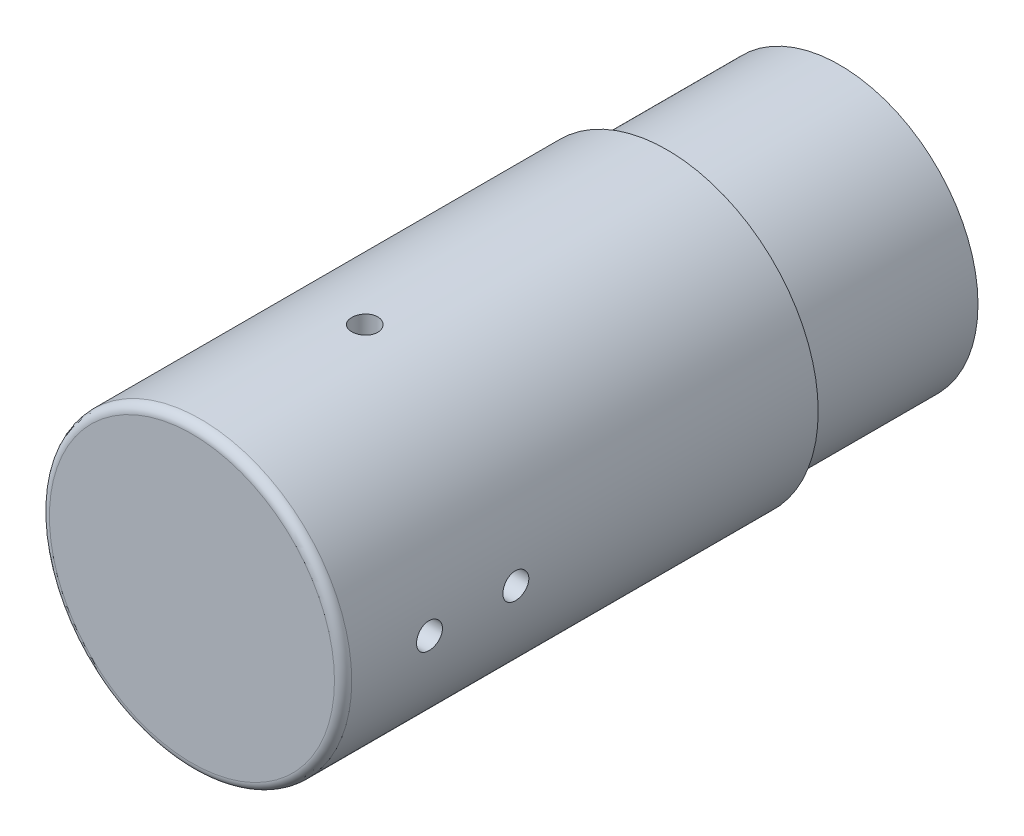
ISO-10303-21;
HEADER;
FILE_DESCRIPTION(('STEP AP214'),'2;1');
FILE_NAME('part.step','',(''),(''),'','','');
FILE_SCHEMA(('AUTOMOTIVE_DESIGN { 1 0 10303 214 1 1 1 1 }'));
ENDSEC;
DATA;
#1=APPLICATION_CONTEXT('core data for automotive mechanical design processes');
#2=APPLICATION_PROTOCOL_DEFINITION('international standard','automotive_design',2000,#1);
#3=PRODUCT_CONTEXT('',#1,'mechanical');
#4=PRODUCT('Part','Part','',(#3));
#5=PRODUCT_RELATED_PRODUCT_CATEGORY('part','',(#4));
#6=PRODUCT_DEFINITION_FORMATION('','',#4);
#7=PRODUCT_DEFINITION_CONTEXT('part definition',#1,'design');
#8=PRODUCT_DEFINITION('design','',#6,#7);
#9=PRODUCT_DEFINITION_SHAPE('','',#8);
#10=(LENGTH_UNIT() NAMED_UNIT(*) SI_UNIT(.MILLI.,.METRE.));
#11=(NAMED_UNIT(*) PLANE_ANGLE_UNIT() SI_UNIT($,.RADIAN.));
#12=(NAMED_UNIT(*) SI_UNIT($,.STERADIAN.) SOLID_ANGLE_UNIT());
#13=UNCERTAINTY_MEASURE_WITH_UNIT(LENGTH_MEASURE(1.E-05),#10,'distance_accuracy_value','');
#14=(GEOMETRIC_REPRESENTATION_CONTEXT(3) GLOBAL_UNCERTAINTY_ASSIGNED_CONTEXT((#13)) GLOBAL_UNIT_ASSIGNED_CONTEXT((#10,
#11,#12)) REPRESENTATION_CONTEXT('',''));
#15=CARTESIAN_POINT('',(0.,0.,0.));
#16=DIRECTION('',(0.,0.,1.));
#17=DIRECTION('',(1.,0.,0.));
#18=AXIS2_PLACEMENT_3D('',#15,#16,#17);
#19=CARTESIAN_POINT('',(0.,0.,-55.));
#20=DIRECTION('',(0.,0.,1.));
#21=DIRECTION('',(1.,0.,0.));
#22=AXIS2_PLACEMENT_3D('',#19,#20,#21);
#23=PLANE('',#22);
#24=CARTESIAN_POINT('',(0.,0.,-55.));
#25=DIRECTION('',(0.,0.,1.));
#26=DIRECTION('',(1.,0.,0.));
#27=AXIS2_PLACEMENT_3D('',#24,#25,#26);
#28=CIRCLE('',#27,17.5);
#29=CARTESIAN_POINT('',(17.5,0.,-55.));
#30=VERTEX_POINT('',#29);
#31=EDGE_CURVE('E131',#30,#30,#28,.T.);
#32=ORIENTED_EDGE('',*,*,#31,.F.);
#33=EDGE_LOOP('',(#32));
#34=FACE_BOUND('',#33,.T.);
#35=CARTESIAN_POINT('',(0.,0.,-55.));
#36=DIRECTION('',(0.,0.,1.));
#37=DIRECTION('',(1.,0.,0.));
#38=AXIS2_PLACEMENT_3D('',#35,#36,#37);
#39=CIRCLE('',#38,16.);
#40=CARTESIAN_POINT('',(16.,0.,-55.));
#41=VERTEX_POINT('',#40);
#42=EDGE_CURVE('E49',#41,#41,#39,.F.);
#43=ORIENTED_EDGE('',*,*,#42,.F.);
#44=EDGE_LOOP('',(#43));
#45=FACE_BOUND('',#44,.T.);
#46=ADVANCED_FACE('F33',(#34,#45),#23,.F.);
#47=CARTESIAN_POINT('',(0.,0.,-55.));
#48=DIRECTION('',(0.,0.,1.));
#49=DIRECTION('',(1.,0.,0.));
#50=AXIS2_PLACEMENT_3D('',#47,#48,#49);
#51=CYLINDRICAL_SURFACE('',#50,17.5);
#52=CARTESIAN_POINT('',(17.5,0.,-11.5));
#53=CARTESIAN_POINT('',(17.4999991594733,0.0840900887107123,-11.4999963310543));
#54=CARTESIAN_POINT('',(17.4993874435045,0.168237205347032,-11.4929050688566));
#55=CARTESIAN_POINT('',(17.4970060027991,0.334202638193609,-11.4647213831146));
#56=CARTESIAN_POINT('',(17.4952349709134,0.416018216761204,-11.4436131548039));
#57=CARTESIAN_POINT('',(17.4907350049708,0.574892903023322,-11.3880109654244));
#58=CARTESIAN_POINT('',(17.4880066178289,0.65195469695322,-11.3535246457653));
#59=CARTESIAN_POINT('',(17.4818977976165,0.799177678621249,-11.2721590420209));
#60=CARTESIAN_POINT('',(17.478517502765,0.869340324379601,-11.2252823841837));
#61=CARTESIAN_POINT('',(17.4714739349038,1.00098012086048,-11.1203308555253));
#62=CARTESIAN_POINT('',(17.4678100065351,1.06243616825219,-11.0622295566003));
#63=CARTESIAN_POINT('',(17.4606176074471,1.17473714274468,-10.936533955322));
#64=CARTESIAN_POINT('',(17.4570891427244,1.22558160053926,-10.8689392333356));
#65=CARTESIAN_POINT('',(17.4505601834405,1.31528804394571,-10.7260471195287));
#66=CARTESIAN_POINT('',(17.447560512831,1.3541313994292,-10.6507379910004));
#67=CARTESIAN_POINT('',(17.4424363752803,1.41861401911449,-10.4946365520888));
#68=CARTESIAN_POINT('',(17.4403118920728,1.44425352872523,-10.4138443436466));
#69=CARTESIAN_POINT('',(17.4371842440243,1.48153922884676,-10.2492821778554));
#70=CARTESIAN_POINT('',(17.4361783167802,1.49321989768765,-10.1655200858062));
#71=CARTESIAN_POINT('',(17.4353929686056,1.50236286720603,-9.99721865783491));
#72=CARTESIAN_POINT('',(17.4356135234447,1.49982544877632,-9.91267933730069));
#73=CARTESIAN_POINT('',(17.4372537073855,1.48063275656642,-9.74545967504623));
#74=CARTESIAN_POINT('',(17.4386701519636,1.4640149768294,-9.66277499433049));
#75=CARTESIAN_POINT('',(17.4425375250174,1.41719154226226,-9.50137274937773));
#76=CARTESIAN_POINT('',(17.4449884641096,1.38698574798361,-9.42265522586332));
#77=CARTESIAN_POINT('',(17.4506523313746,1.31380181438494,-9.27130244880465));
#78=CARTESIAN_POINT('',(17.4538662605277,1.27080687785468,-9.19867535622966));
#79=CARTESIAN_POINT('',(17.4606930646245,1.17327723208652,-9.06165431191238));
#80=CARTESIAN_POINT('',(17.4643059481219,1.11874227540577,-8.99726053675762));
#81=CARTESIAN_POINT('',(17.4715377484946,0.999470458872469,-8.87831603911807));
#82=CARTESIAN_POINT('',(17.4751566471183,0.934701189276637,-8.82379780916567));
#83=CARTESIAN_POINT('',(17.4819816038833,0.796912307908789,-8.72640328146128));
#84=CARTESIAN_POINT('',(17.4851876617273,0.723892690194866,-8.68352699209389));
#85=CARTESIAN_POINT('',(17.4908263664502,0.571654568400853,-8.61063537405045));
#86=CARTESIAN_POINT('',(17.4932589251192,0.492435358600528,-8.58062151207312));
#87=CARTESIAN_POINT('',(17.497075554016,0.330056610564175,-8.53432962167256));
#88=CARTESIAN_POINT('',(17.4984596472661,0.246897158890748,-8.51805129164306));
#89=CARTESIAN_POINT('',(17.5000204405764,0.0792801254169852,-8.49973334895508));
#90=CARTESIAN_POINT('',(17.50020094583,-0.00517251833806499,-8.49764886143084));
#91=CARTESIAN_POINT('',(17.4993443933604,-0.173226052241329,-8.50766017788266));
#92=CARTESIAN_POINT('',(17.4983073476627,-0.256826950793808,-8.51975584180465));
#93=CARTESIAN_POINT('',(17.4951347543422,-0.420675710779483,-8.55774691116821));
#94=CARTESIAN_POINT('',(17.4930008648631,-0.500928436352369,-8.58362148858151));
#95=CARTESIAN_POINT('',(17.4878742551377,-0.655953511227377,-8.64841461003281));
#96=CARTESIAN_POINT('',(17.4848815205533,-0.73072576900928,-8.68733337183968));
#97=CARTESIAN_POINT('',(17.4783631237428,-0.872871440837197,-8.77722267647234));
#98=CARTESIAN_POINT('',(17.4748361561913,-0.940226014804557,-8.82822291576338));
#99=CARTESIAN_POINT('',(17.467649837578,-1.06543412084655,-8.94078460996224));
#100=CARTESIAN_POINT('',(17.4639904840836,-1.1232874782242,-9.00234625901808));
#101=CARTESIAN_POINT('',(17.4569405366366,-1.22800508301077,-9.13447813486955));
#102=CARTESIAN_POINT('',(17.4535506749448,-1.27484002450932,-9.20507163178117));
#103=CARTESIAN_POINT('',(17.4474340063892,-1.35599031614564,-9.35314762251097));
#104=CARTESIAN_POINT('',(17.4447071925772,-1.39030579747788,-9.43063004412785));
#105=CARTESIAN_POINT('',(17.4402295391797,-1.4453932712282,-9.590181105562));
#106=CARTESIAN_POINT('',(17.4384774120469,-1.46618313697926,-9.67224353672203));
#107=CARTESIAN_POINT('',(17.4361432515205,-1.49368739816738,-9.83871002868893));
#108=CARTESIAN_POINT('',(17.435561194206,-1.5004020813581,-9.92311404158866));
#109=CARTESIAN_POINT('',(17.4356334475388,-1.49956196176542,-10.0915765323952));
#110=CARTESIAN_POINT('',(17.4362837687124,-1.49205320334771,-10.1756352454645));
#111=CARTESIAN_POINT('',(17.4387390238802,-1.46307542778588,-10.3412929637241));
#112=CARTESIAN_POINT('',(17.4405439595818,-1.44160638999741,-10.4228919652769));
#113=CARTESIAN_POINT('',(17.4451040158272,-1.3853292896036,-10.5813165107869));
#114=CARTESIAN_POINT('',(17.447859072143,-1.35052212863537,-10.6581423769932));
#115=CARTESIAN_POINT('',(17.4540090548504,-1.26856192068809,-10.8048677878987));
#116=CARTESIAN_POINT('',(17.4574039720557,-1.2214090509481,-10.8747674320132));
#117=CARTESIAN_POINT('',(17.4644642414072,-1.11592285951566,-11.0058919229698));
#118=CARTESIAN_POINT('',(17.4681303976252,-1.05755540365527,-11.0670892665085));
#119=CARTESIAN_POINT('',(17.4753127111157,-0.931359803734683,-11.1788440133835));
#120=CARTESIAN_POINT('',(17.4788288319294,-0.863529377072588,-11.2293988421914));
#121=CARTESIAN_POINT('',(17.4853216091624,-0.720195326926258,-11.3185054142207));
#122=CARTESIAN_POINT('',(17.4882972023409,-0.644677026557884,-11.3570336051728));
#123=CARTESIAN_POINT('',(17.4933613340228,-0.488268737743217,-11.4208133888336));
#124=CARTESIAN_POINT('',(17.4954508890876,-0.407385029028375,-11.4460802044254));
#125=CARTESIAN_POINT('',(17.4979725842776,-0.271688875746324,-11.4762027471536));
#126=CARTESIAN_POINT('',(17.4987293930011,-0.217748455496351,-11.4851148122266));
#127=CARTESIAN_POINT('',(17.4997433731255,-0.109213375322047,-11.4970146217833));
#128=CARTESIAN_POINT('',(17.5000005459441,-0.0546187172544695,-11.5000023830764));
#129=CARTESIAN_POINT('',(17.5,0.,-11.5));
#130=B_SPLINE_CURVE_WITH_KNOTS('',3,(#52,#53,#54,#55,#56,#57,#58,#59,#60,#61,#62,#63,#64,#65,
#66,#67,#68,#69,#70,#71,#72,#73,#74,#75,#76,#77,#78,#79,#80,#81,#82,#83,#84,#85,#86,#87,#88,#89,
#90,#91,#92,#93,#94,#95,#96,#97,#98,#99,#100,#101,#102,#103,#104,#105,#106,#107,#108,#109,#110,
#111,#112,#113,#114,#115,#116,#117,#118,#119,#120,#121,#122,#123,#124,#125,#126,#127,#128,#129),
.UNSPECIFIED.,.T.,.F.,(4,2,2,2,2,2,2,2,2,2,2,2,2,2,2,2,2,2,2,2,2,2,2,2,2,2,2,2,2,2,2,2,2,2,2,2,
2,2,4),(0.,0.252070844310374,0.504426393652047,0.756638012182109,1.00879621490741,
1.26155551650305,1.51432599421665,1.76748691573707,2.02064313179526,2.27317275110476,
2.52569738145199,2.77755167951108,3.02940856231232,3.28159770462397,3.53379225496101,
3.78680207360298,4.03981207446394,4.29285091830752,4.54588420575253,4.79811713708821,
5.0503475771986,5.30219782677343,5.55405228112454,5.80653234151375,6.05901704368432,
6.31216587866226,6.5653120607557,6.81812304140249,7.07092885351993,7.32291767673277,
7.57490687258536,7.82687903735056,8.07884758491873,8.33159556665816,8.58440462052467,
8.83770569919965,9.09071537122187,9.2544424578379,9.41816907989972),.UNSPECIFIED.);
#131=CARTESIAN_POINT('',(17.5,0.,-11.5));
#132=VERTEX_POINT('',#131);
#133=EDGE_CURVE('E95',#132,#132,#130,.T.);
#134=ORIENTED_EDGE('',*,*,#133,.F.);
#135=EDGE_LOOP('',(#134));
#136=FACE_BOUND('',#135,.T.);
#137=CARTESIAN_POINT('',(0.,0.,-1.));
#138=DIRECTION('',(0.,0.,1.));
#139=DIRECTION('',(1.,0.,0.));
#140=AXIS2_PLACEMENT_3D('',#137,#138,#139);
#141=CIRCLE('',#140,17.5);
#142=CARTESIAN_POINT('',(17.5,0.,-1.));
#143=VERTEX_POINT('',#142);
#144=EDGE_CURVE('E10',#143,#143,#141,.F.);
#145=ORIENTED_EDGE('',*,*,#144,.T.);
#146=EDGE_LOOP('',(#145));
#147=FACE_BOUND('',#146,.T.);
#148=CARTESIAN_POINT('',(-1.50000000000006,17.4355957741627,-20.));
#149=CARTESIAN_POINT('',(-1.49999633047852,17.4355966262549,-19.9159105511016));
#150=CARTESIAN_POINT('',(-1.49290517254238,17.4362106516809,-19.8317640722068));
#151=CARTESIAN_POINT('',(-1.46472193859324,17.4386003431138,-19.665799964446));
#152=CARTESIAN_POINT('',(-1.44361405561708,17.4403773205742,-19.5839850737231));
#153=CARTESIAN_POINT('',(-1.38801287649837,17.4448901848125,-19.4251118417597));
#154=CARTESIAN_POINT('',(-1.35352723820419,17.4476255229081,-19.3480508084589));
#155=CARTESIAN_POINT('',(-1.27216323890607,17.4537462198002,-19.2008291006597));
#156=CARTESIAN_POINT('',(-1.22528750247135,17.4571314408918,-19.1306669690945));
#157=CARTESIAN_POINT('',(-1.12033690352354,17.4641807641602,-18.9990265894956));
#158=CARTESIAN_POINT('',(-1.0622354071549,17.4678455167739,-18.9375696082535));
#159=CARTESIAN_POINT('',(-0.936539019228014,17.4750350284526,-18.8252668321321));
#160=CARTESIAN_POINT('',(-0.868943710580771,17.4785597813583,-18.7744215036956));
#161=CARTESIAN_POINT('',(-0.726051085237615,17.4850783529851,-18.6847141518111));
#162=CARTESIAN_POINT('',(-0.65074213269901,17.4880713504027,-18.6458705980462));
#163=CARTESIAN_POINT('',(-0.494641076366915,17.493182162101,-18.5813875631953));
#164=CARTESIAN_POINT('',(-0.413849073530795,17.4952999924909,-18.5557478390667));
#165=CARTESIAN_POINT('',(-0.249287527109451,17.4984172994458,-18.5184616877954));
#166=CARTESIAN_POINT('',(-0.16552585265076,17.4994195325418,-18.5067807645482));
#167=CARTESIAN_POINT('',(0.00277475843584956,17.5002020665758,-18.4976371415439));
#168=CARTESIAN_POINT('',(0.0873136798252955,17.4999823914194,-18.5001741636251));
#169=CARTESIAN_POINT('',(0.254535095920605,17.4983481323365,-18.5193662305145));
#170=CARTESIAN_POINT('',(0.337221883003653,17.4969366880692,-18.5359841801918));
#171=CARTESIAN_POINT('',(0.498628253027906,17.4930812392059,-18.5828086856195));
#172=CARTESIAN_POINT('',(0.57734779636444,17.4906372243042,-18.6130153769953));
#173=CARTESIAN_POINT('',(0.728703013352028,17.4849861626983,-18.6862011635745));
#174=CARTESIAN_POINT('',(0.801330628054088,17.4817781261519,-18.7291968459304));
#175=CARTESIAN_POINT('',(0.938352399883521,17.4749594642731,-18.8267280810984));
#176=CARTESIAN_POINT('',(1.00274638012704,17.4713488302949,-18.8812638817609));
#177=CARTESIAN_POINT('',(1.12168991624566,17.4641169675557,-19.000536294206));
#178=CARTESIAN_POINT('',(1.17620715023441,17.4604957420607,-19.0653051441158));
#179=CARTESIAN_POINT('',(1.27359986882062,17.4536624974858,-19.2030928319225));
#180=CARTESIAN_POINT('',(1.31647534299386,17.4504504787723,-19.2761116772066));
#181=CARTESIAN_POINT('',(1.3893663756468,17.4447987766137,-19.4283495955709));
#182=CARTESIAN_POINT('',(1.41938021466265,17.4423591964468,-19.507569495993));
#183=CARTESIAN_POINT('',(1.46567184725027,17.4385306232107,-19.6699497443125));
#184=CARTESIAN_POINT('',(1.48194994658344,17.4371416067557,-19.7531100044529));
#185=CARTESIAN_POINT('',(1.50026701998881,17.4355752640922,-19.9207274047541));
#186=CARTESIAN_POINT('',(1.50235108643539,17.4353941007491,-20.0051795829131));
#187=CARTESIAN_POINT('',(1.49233909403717,17.4362538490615,-20.1732320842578));
#188=CARTESIAN_POINT('',(1.48024317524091,17.4372947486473,-20.2568324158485));
#189=CARTESIAN_POINT('',(1.44225218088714,17.4404778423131,-20.4206784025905));
#190=CARTESIAN_POINT('',(1.41637818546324,17.4426183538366,-20.5009289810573));
#191=CARTESIAN_POINT('',(1.35158694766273,17.4477580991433,-20.6559500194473));
#192=CARTESIAN_POINT('',(1.31266948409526,17.4507573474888,-20.730720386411));
#193=CARTESIAN_POINT('',(1.2227820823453,17.4572859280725,-20.8728647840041));
#194=CARTESIAN_POINT('',(1.17178211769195,17.4608165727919,-20.9402197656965));
#195=CARTESIAN_POINT('',(1.05922073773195,17.4680057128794,-21.0654288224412));
#196=CARTESIAN_POINT('',(0.997659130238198,17.4716642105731,-21.1232827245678));
#197=CARTESIAN_POINT('',(0.865527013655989,17.4787082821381,-21.2280014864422));
#198=CARTESIAN_POINT('',(0.794933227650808,17.4820931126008,-21.2748370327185));
#199=CARTESIAN_POINT('',(0.646856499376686,17.4881977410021,-21.3559883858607));
#200=CARTESIAN_POINT('',(0.569373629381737,17.4909175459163,-21.3903043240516));
#201=CARTESIAN_POINT('',(0.409822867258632,17.4953822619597,-21.4453921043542));
#202=CARTESIAN_POINT('',(0.327761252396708,17.4971284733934,-21.4661820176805));
#203=CARTESIAN_POINT('',(0.161296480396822,17.499454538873,-21.4936866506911));
#204=CARTESIAN_POINT('',(0.0768933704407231,17.5000344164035,-21.5004016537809));
#205=CARTESIAN_POINT('',(-0.0915696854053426,17.4999625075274,-21.4995624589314));
#206=CARTESIAN_POINT('',(-0.175629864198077,17.4993146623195,-21.4920539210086));
#207=CARTESIAN_POINT('',(-0.341290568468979,17.4968678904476,-21.4630760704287));
#208=CARTESIAN_POINT('',(-0.422891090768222,17.4950689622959,-21.4416067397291));
#209=CARTESIAN_POINT('',(-0.581318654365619,17.4905218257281,-21.3853284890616));
#210=CARTESIAN_POINT('',(-0.658146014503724,17.4877736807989,-21.350520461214));
#211=CARTESIAN_POINT('',(-0.804874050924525,17.4816354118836,-21.2685580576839));
#212=CARTESIAN_POINT('',(-0.874774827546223,17.4782452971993,-21.2214038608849));
#213=CARTESIAN_POINT('',(-1.00589923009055,17.4711905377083,-21.1159162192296));
#214=CARTESIAN_POINT('',(-1.06709559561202,17.4675250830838,-21.0575489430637));
#215=CARTESIAN_POINT('',(-1.17884845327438,17.4603396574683,-20.93135410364));
#216=CARTESIAN_POINT('',(-1.22940236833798,17.4568197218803,-20.8635242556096));
#217=CARTESIAN_POINT('',(-1.31850796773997,17.4503164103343,-20.7201906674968));
#218=CARTESIAN_POINT('',(-1.35703593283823,17.4473340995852,-20.6446721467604));
#219=CARTESIAN_POINT('',(-1.42081523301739,17.4422566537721,-20.4882633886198));
#220=CARTESIAN_POINT('',(-1.44608179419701,17.4401605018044,-20.4073794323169));
#221=CARTESIAN_POINT('',(-1.47620361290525,17.4376304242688,-20.2716839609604));
#222=CARTESIAN_POINT('',(-1.4851153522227,17.4368709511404,-20.2177445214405));
#223=CARTESIAN_POINT('',(-1.49701472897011,17.4358533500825,-20.1092114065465));
#224=CARTESIAN_POINT('',(-1.5000023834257,17.4355952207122,-20.054617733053));
#225=CARTESIAN_POINT('',(-1.50000000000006,17.4355957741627,-20.));
#226=B_SPLINE_CURVE_WITH_KNOTS('',3,(#148,#149,#150,#151,#152,#153,#154,#155,#156,#157,#158,
#159,#160,#161,#162,#163,#164,#165,#166,#167,#168,#169,#170,#171,#172,#173,#174,#175,#176,#177,
#178,#179,#180,#181,#182,#183,#184,#185,#186,#187,#188,#189,#190,#191,#192,#193,#194,#195,#196,
#197,#198,#199,#200,#201,#202,#203,#204,#205,#206,#207,#208,#209,#210,#211,#212,#213,#214,#215,
#216,#217,#218,#219,#220,#221,#222,#223,#224,#225),.UNSPECIFIED.,.T.,.F.,(4,2,2,2,2,2,2,2,2,2,2,
2,2,2,2,2,2,2,2,2,2,2,2,2,2,2,2,2,2,2,2,2,2,2,2,2,2,2,4),(0.,0.25206892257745,0.504422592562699,
0.756632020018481,1.00878806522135,1.26154988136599,1.51432280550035,1.76748280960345,
2.02063815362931,2.27316657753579,2.5256900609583,2.77755035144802,3.02941315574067,
3.28160405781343,3.53380037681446,3.78680766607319,4.03981518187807,4.29285651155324,
4.54589220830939,4.7981236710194,5.05035264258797,5.30219681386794,5.55404525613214,
5.80652626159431,6.05901186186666,6.31216177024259,6.56530902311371,6.81811736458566,
7.07092061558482,7.32291369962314,7.57490710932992,7.82688366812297,8.07885657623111,
8.33160201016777,8.58440857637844,8.83771065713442,9.09072126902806,9.25444540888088,
9.41816907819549),.UNSPECIFIED.);
#227=CARTESIAN_POINT('',(-1.50000000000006,17.4355957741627,-20.));
#228=VERTEX_POINT('',#227);
#229=EDGE_CURVE('E58',#228,#228,#226,.T.);
#230=ORIENTED_EDGE('',*,*,#229,.F.);
#231=EDGE_LOOP('',(#230));
#232=FACE_BOUND('',#231,.T.);
#233=CARTESIAN_POINT('',(-17.5,0.,-18.5));
#234=CARTESIAN_POINT('',(-17.4999991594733,0.0840900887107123,-18.5000036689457));
#235=CARTESIAN_POINT('',(-17.4993874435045,0.168237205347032,-18.5070949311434));
#236=CARTESIAN_POINT('',(-17.4970060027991,0.334202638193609,-18.5352786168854));
#237=CARTESIAN_POINT('',(-17.4952349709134,0.416018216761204,-18.5563868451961));
#238=CARTESIAN_POINT('',(-17.4907350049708,0.574892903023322,-18.6119890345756));
#239=CARTESIAN_POINT('',(-17.4880066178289,0.65195469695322,-18.6464753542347));
#240=CARTESIAN_POINT('',(-17.4818977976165,0.799177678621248,-18.7278409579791));
#241=CARTESIAN_POINT('',(-17.478517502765,0.869340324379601,-18.7747176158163));
#242=CARTESIAN_POINT('',(-17.4714739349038,1.00098012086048,-18.8796691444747));
#243=CARTESIAN_POINT('',(-17.4678100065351,1.0624361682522,-18.9377704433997));
#244=CARTESIAN_POINT('',(-17.4606176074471,1.17473714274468,-19.063466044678));
#245=CARTESIAN_POINT('',(-17.4570891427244,1.22558160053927,-19.1310607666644));
#246=CARTESIAN_POINT('',(-17.4505601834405,1.31528804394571,-19.2739528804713));
#247=CARTESIAN_POINT('',(-17.447560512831,1.3541313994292,-19.3492620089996));
#248=CARTESIAN_POINT('',(-17.4424363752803,1.41861401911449,-19.5053634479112));
#249=CARTESIAN_POINT('',(-17.4403118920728,1.44425352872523,-19.5861556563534));
#250=CARTESIAN_POINT('',(-17.4371842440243,1.48153922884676,-19.7507178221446));
#251=CARTESIAN_POINT('',(-17.4361783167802,1.49321989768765,-19.8344799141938));
#252=CARTESIAN_POINT('',(-17.4353929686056,1.50236286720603,-20.0027813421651));
#253=CARTESIAN_POINT('',(-17.4356135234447,1.49982544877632,-20.0873206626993));
#254=CARTESIAN_POINT('',(-17.4372537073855,1.48063275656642,-20.2545403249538));
#255=CARTESIAN_POINT('',(-17.4386701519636,1.4640149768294,-20.3372250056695));
#256=CARTESIAN_POINT('',(-17.4425375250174,1.41719154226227,-20.4986272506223));
#257=CARTESIAN_POINT('',(-17.4449884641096,1.38698574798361,-20.5773447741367));
#258=CARTESIAN_POINT('',(-17.4506523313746,1.31380181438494,-20.7286975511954));
#259=CARTESIAN_POINT('',(-17.4538662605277,1.27080687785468,-20.8013246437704));
#260=CARTESIAN_POINT('',(-17.4606930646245,1.17327723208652,-20.9383456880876));
#261=CARTESIAN_POINT('',(-17.4643059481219,1.11874227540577,-21.0027394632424));
#262=CARTESIAN_POINT('',(-17.4715377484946,0.99947045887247,-21.1216839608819));
#263=CARTESIAN_POINT('',(-17.4751566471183,0.934701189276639,-21.1762021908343));
#264=CARTESIAN_POINT('',(-17.4819816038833,0.79691230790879,-21.2735967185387));
#265=CARTESIAN_POINT('',(-17.4851876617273,0.723892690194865,-21.3164730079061));
#266=CARTESIAN_POINT('',(-17.4908263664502,0.571654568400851,-21.3893646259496));
#267=CARTESIAN_POINT('',(-17.4932589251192,0.492435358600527,-21.4193784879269));
#268=CARTESIAN_POINT('',(-17.497075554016,0.330056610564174,-21.4656703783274));
#269=CARTESIAN_POINT('',(-17.4984596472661,0.246897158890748,-21.4819487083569));
#270=CARTESIAN_POINT('',(-17.5000204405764,0.0792801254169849,-21.5002666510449));
#271=CARTESIAN_POINT('',(-17.50020094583,-0.00517251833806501,-21.5023511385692));
#272=CARTESIAN_POINT('',(-17.4993443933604,-0.173226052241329,-21.4923398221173));
#273=CARTESIAN_POINT('',(-17.4983073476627,-0.256826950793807,-21.4802441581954));
#274=CARTESIAN_POINT('',(-17.4951347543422,-0.420675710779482,-21.4422530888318));
#275=CARTESIAN_POINT('',(-17.4930008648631,-0.500928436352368,-21.4163785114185));
#276=CARTESIAN_POINT('',(-17.4878742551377,-0.655953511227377,-21.3515853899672));
#277=CARTESIAN_POINT('',(-17.4848815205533,-0.73072576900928,-21.3126666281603));
#278=CARTESIAN_POINT('',(-17.4783631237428,-0.872871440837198,-21.2227773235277));
#279=CARTESIAN_POINT('',(-17.4748361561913,-0.940226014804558,-21.1717770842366));
#280=CARTESIAN_POINT('',(-17.467649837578,-1.06543412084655,-21.0592153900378));
#281=CARTESIAN_POINT('',(-17.4639904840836,-1.1232874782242,-20.9976537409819));
#282=CARTESIAN_POINT('',(-17.4569405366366,-1.22800508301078,-20.8655218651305));
#283=CARTESIAN_POINT('',(-17.4535506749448,-1.27484002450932,-20.7949283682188));
#284=CARTESIAN_POINT('',(-17.4474340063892,-1.35599031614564,-20.646852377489));
#285=CARTESIAN_POINT('',(-17.4447071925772,-1.39030579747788,-20.5693699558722));
#286=CARTESIAN_POINT('',(-17.4402295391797,-1.4453932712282,-20.409818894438));
#287=CARTESIAN_POINT('',(-17.4384774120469,-1.46618313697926,-20.327756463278));
#288=CARTESIAN_POINT('',(-17.4361432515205,-1.49368739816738,-20.1612899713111));
#289=CARTESIAN_POINT('',(-17.435561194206,-1.5004020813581,-20.0768859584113));
#290=CARTESIAN_POINT('',(-17.4356334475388,-1.49956196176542,-19.9084234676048));
#291=CARTESIAN_POINT('',(-17.4362837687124,-1.49205320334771,-19.8243647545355));
#292=CARTESIAN_POINT('',(-17.4387390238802,-1.46307542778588,-19.6587070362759));
#293=CARTESIAN_POINT('',(-17.4405439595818,-1.44160638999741,-19.5771080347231));
#294=CARTESIAN_POINT('',(-17.4451040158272,-1.3853292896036,-19.4186834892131));
#295=CARTESIAN_POINT('',(-17.447859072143,-1.35052212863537,-19.3418576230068));
#296=CARTESIAN_POINT('',(-17.4540090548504,-1.26856192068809,-19.1951322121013));
#297=CARTESIAN_POINT('',(-17.4574039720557,-1.2214090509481,-19.1252325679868));
#298=CARTESIAN_POINT('',(-17.4644642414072,-1.11592285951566,-18.9941080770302));
#299=CARTESIAN_POINT('',(-17.4681303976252,-1.05755540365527,-18.9329107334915));
#300=CARTESIAN_POINT('',(-17.4753127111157,-0.931359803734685,-18.8211559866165));
#301=CARTESIAN_POINT('',(-17.4788288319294,-0.86352937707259,-18.7706011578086));
#302=CARTESIAN_POINT('',(-17.4853216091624,-0.720195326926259,-18.6814945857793));
#303=CARTESIAN_POINT('',(-17.4882972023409,-0.644677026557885,-18.6429663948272));
#304=CARTESIAN_POINT('',(-17.4933613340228,-0.488268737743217,-18.5791866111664));
#305=CARTESIAN_POINT('',(-17.4954508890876,-0.407385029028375,-18.5539197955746));
#306=CARTESIAN_POINT('',(-17.4979725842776,-0.271688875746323,-18.5237972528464));
#307=CARTESIAN_POINT('',(-17.4987293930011,-0.21774845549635,-18.5148851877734));
#308=CARTESIAN_POINT('',(-17.4997433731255,-0.109213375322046,-18.5029853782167));
#309=CARTESIAN_POINT('',(-17.5000005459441,-0.054618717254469,-18.4999976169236));
#310=CARTESIAN_POINT('',(-17.5,0.,-18.5));
#311=B_SPLINE_CURVE_WITH_KNOTS('',3,(#233,#234,#235,#236,#237,#238,#239,#240,#241,#242,#243,
#244,#245,#246,#247,#248,#249,#250,#251,#252,#253,#254,#255,#256,#257,#258,#259,#260,#261,#262,
#263,#264,#265,#266,#267,#268,#269,#270,#271,#272,#273,#274,#275,#276,#277,#278,#279,#280,#281,
#282,#283,#284,#285,#286,#287,#288,#289,#290,#291,#292,#293,#294,#295,#296,#297,#298,#299,#300,
#301,#302,#303,#304,#305,#306,#307,#308,#309,#310),.UNSPECIFIED.,.T.,.F.,(4,2,2,2,2,2,2,2,2,2,2,
2,2,2,2,2,2,2,2,2,2,2,2,2,2,2,2,2,2,2,2,2,2,2,2,2,2,2,4),(0.,0.252070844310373,
0.504426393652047,0.756638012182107,1.0087962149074,1.26155551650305,1.51432599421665,
1.76748691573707,2.02064313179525,2.27317275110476,2.525697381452,2.77755167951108,
3.02940856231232,3.28159770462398,3.53379225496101,3.78680207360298,4.03981207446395,
4.29285091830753,4.54588420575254,4.79811713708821,5.0503475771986,5.30219782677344,
5.55405228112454,5.80653234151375,6.05901704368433,6.31216587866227,6.5653120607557,
6.8181230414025,7.07092885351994,7.32291767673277,7.57490687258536,7.82687903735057,
8.07884758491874,8.33159556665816,8.58440462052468,8.83770569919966,9.09071537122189,
9.25444245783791,9.41816907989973),.UNSPECIFIED.);
#312=CARTESIAN_POINT('',(-17.5,0.,-18.5));
#313=VERTEX_POINT('',#312);
#314=EDGE_CURVE('E59',#313,#313,#311,.T.);
#315=ORIENTED_EDGE('',*,*,#314,.F.);
#316=EDGE_LOOP('',(#315));
#317=FACE_BOUND('',#316,.T.);
#318=CARTESIAN_POINT('',(-1.49999999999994,-17.4355957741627,-20.));
#319=CARTESIAN_POINT('',(-1.4999963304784,-17.435596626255,-20.0840894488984));
#320=CARTESIAN_POINT('',(-1.49290517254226,-17.4362106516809,-20.1682359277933));
#321=CARTESIAN_POINT('',(-1.46472193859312,-17.4386003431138,-20.334200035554));
#322=CARTESIAN_POINT('',(-1.44361405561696,-17.4403773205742,-20.4160149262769));
#323=CARTESIAN_POINT('',(-1.38801287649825,-17.4448901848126,-20.5748881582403));
#324=CARTESIAN_POINT('',(-1.35352723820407,-17.4476255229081,-20.6519491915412));
#325=CARTESIAN_POINT('',(-1.27216323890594,-17.4537462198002,-20.7991708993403));
#326=CARTESIAN_POINT('',(-1.22528750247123,-17.4571314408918,-20.8693330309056));
#327=CARTESIAN_POINT('',(-1.12033690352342,-17.4641807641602,-21.0009734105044));
#328=CARTESIAN_POINT('',(-1.06223540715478,-17.4678455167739,-21.0624303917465));
#329=CARTESIAN_POINT('',(-0.936539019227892,-17.4750350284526,-21.1747331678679));
#330=CARTESIAN_POINT('',(-0.868943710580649,-17.4785597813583,-21.2255784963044));
#331=CARTESIAN_POINT('',(-0.726051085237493,-17.4850783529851,-21.3152858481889));
#332=CARTESIAN_POINT('',(-0.650742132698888,-17.4880713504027,-21.3541294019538));
#333=CARTESIAN_POINT('',(-0.494641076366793,-17.493182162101,-21.4186124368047));
#334=CARTESIAN_POINT('',(-0.413849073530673,-17.4952999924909,-21.4442521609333));
#335=CARTESIAN_POINT('',(-0.249287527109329,-17.4984172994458,-21.4815383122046));
#336=CARTESIAN_POINT('',(-0.165525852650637,-17.4994195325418,-21.4932192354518));
#337=CARTESIAN_POINT('',(0.00277475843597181,-17.5002020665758,-21.5023628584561));
#338=CARTESIAN_POINT('',(0.0873136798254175,-17.4999823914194,-21.4998258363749));
#339=CARTESIAN_POINT('',(0.254535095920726,-17.4983481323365,-21.4806337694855));
#340=CARTESIAN_POINT('',(0.337221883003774,-17.4969366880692,-21.4640158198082));
#341=CARTESIAN_POINT('',(0.498628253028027,-17.4930812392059,-21.4171913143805));
#342=CARTESIAN_POINT('',(0.577347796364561,-17.4906372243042,-21.3869846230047));
#343=CARTESIAN_POINT('',(0.728703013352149,-17.4849861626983,-21.3137988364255));
#344=CARTESIAN_POINT('',(0.80133062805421,-17.4817781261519,-21.2708031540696));
#345=CARTESIAN_POINT('',(0.938352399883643,-17.4749594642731,-21.1732719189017));
#346=CARTESIAN_POINT('',(1.00274638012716,-17.4713488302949,-21.1187361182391));
#347=CARTESIAN_POINT('',(1.12168991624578,-17.4641169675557,-20.999463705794));
#348=CARTESIAN_POINT('',(1.17620715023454,-17.4604957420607,-20.9346948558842));
#349=CARTESIAN_POINT('',(1.27359986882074,-17.4536624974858,-20.7969071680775));
#350=CARTESIAN_POINT('',(1.31647534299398,-17.4504504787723,-20.7238883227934));
#351=CARTESIAN_POINT('',(1.38936637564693,-17.4447987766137,-20.5716504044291));
#352=CARTESIAN_POINT('',(1.41938021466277,-17.4423591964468,-20.492430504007));
#353=CARTESIAN_POINT('',(1.46567184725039,-17.4385306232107,-20.3300502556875));
#354=CARTESIAN_POINT('',(1.48194994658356,-17.4371416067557,-20.2468899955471));
#355=CARTESIAN_POINT('',(1.50026701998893,-17.4355752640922,-20.0792725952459));
#356=CARTESIAN_POINT('',(1.50235108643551,-17.4353941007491,-19.9948204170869));
#357=CARTESIAN_POINT('',(1.49233909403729,-17.4362538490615,-19.8267679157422));
#358=CARTESIAN_POINT('',(1.48024317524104,-17.4372947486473,-19.7431675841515));
#359=CARTESIAN_POINT('',(1.44225218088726,-17.440477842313,-19.5793215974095));
#360=CARTESIAN_POINT('',(1.41637818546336,-17.4426183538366,-19.4990710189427));
#361=CARTESIAN_POINT('',(1.35158694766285,-17.4477580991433,-19.3440499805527));
#362=CARTESIAN_POINT('',(1.31266948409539,-17.4507573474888,-19.269279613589));
#363=CARTESIAN_POINT('',(1.22278208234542,-17.4572859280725,-19.1271352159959));
#364=CARTESIAN_POINT('',(1.17178211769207,-17.4608165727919,-19.0597802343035));
#365=CARTESIAN_POINT('',(1.05922073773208,-17.4680057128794,-18.9345711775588));
#366=CARTESIAN_POINT('',(0.99765913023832,-17.4716642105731,-18.8767172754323));
#367=CARTESIAN_POINT('',(0.865527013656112,-17.4787082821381,-18.7719985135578));
#368=CARTESIAN_POINT('',(0.794933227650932,-17.4820931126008,-18.7251629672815));
#369=CARTESIAN_POINT('',(0.646856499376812,-17.4881977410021,-18.6440116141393));
#370=CARTESIAN_POINT('',(0.569373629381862,-17.4909175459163,-18.6096956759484));
#371=CARTESIAN_POINT('',(0.409822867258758,-17.4953822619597,-18.5546078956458));
#372=CARTESIAN_POINT('',(0.327761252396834,-17.4971284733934,-18.5338179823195));
#373=CARTESIAN_POINT('',(0.161296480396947,-17.499454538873,-18.5063133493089));
#374=CARTESIAN_POINT('',(0.076893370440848,-17.5000344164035,-18.4995983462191));
#375=CARTESIAN_POINT('',(-0.0915696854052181,-17.4999625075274,-18.5004375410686));
#376=CARTESIAN_POINT('',(-0.175629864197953,-17.4993146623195,-18.5079460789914));
#377=CARTESIAN_POINT('',(-0.341290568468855,-17.4968678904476,-18.5369239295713));
#378=CARTESIAN_POINT('',(-0.422891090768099,-17.4950689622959,-18.5583932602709));
#379=CARTESIAN_POINT('',(-0.581318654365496,-17.4905218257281,-18.6146715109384));
#380=CARTESIAN_POINT('',(-0.658146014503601,-17.4877736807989,-18.649479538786));
#381=CARTESIAN_POINT('',(-0.804874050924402,-17.4816354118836,-18.7314419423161));
#382=CARTESIAN_POINT('',(-0.8747748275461,-17.4782452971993,-18.7785961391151));
#383=CARTESIAN_POINT('',(-1.00589923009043,-17.4711905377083,-18.8840837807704));
#384=CARTESIAN_POINT('',(-1.06709559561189,-17.4675250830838,-18.9424510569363));
#385=CARTESIAN_POINT('',(-1.17884845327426,-17.4603396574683,-19.06864589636));
#386=CARTESIAN_POINT('',(-1.22940236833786,-17.4568197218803,-19.1364757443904));
#387=CARTESIAN_POINT('',(-1.31850796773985,-17.4503164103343,-19.2798093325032));
#388=CARTESIAN_POINT('',(-1.35703593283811,-17.4473340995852,-19.3553278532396));
#389=CARTESIAN_POINT('',(-1.42081523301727,-17.4422566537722,-19.5117366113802));
#390=CARTESIAN_POINT('',(-1.44608179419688,-17.4401605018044,-19.5926205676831));
#391=CARTESIAN_POINT('',(-1.47620361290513,-17.4376304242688,-19.7283160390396));
#392=CARTESIAN_POINT('',(-1.48511535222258,-17.4368709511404,-19.7822554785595));
#393=CARTESIAN_POINT('',(-1.49701472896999,-17.4358533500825,-19.8907885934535));
#394=CARTESIAN_POINT('',(-1.50000238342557,-17.4355952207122,-19.945382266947));
#395=CARTESIAN_POINT('',(-1.49999999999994,-17.4355957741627,-20.));
#396=B_SPLINE_CURVE_WITH_KNOTS('',3,(#318,#319,#320,#321,#322,#323,#324,#325,#326,#327,#328,
#329,#330,#331,#332,#333,#334,#335,#336,#337,#338,#339,#340,#341,#342,#343,#344,#345,#346,#347,
#348,#349,#350,#351,#352,#353,#354,#355,#356,#357,#358,#359,#360,#361,#362,#363,#364,#365,#366,
#367,#368,#369,#370,#371,#372,#373,#374,#375,#376,#377,#378,#379,#380,#381,#382,#383,#384,#385,
#386,#387,#388,#389,#390,#391,#392,#393,#394,#395),.UNSPECIFIED.,.T.,.F.,(4,2,2,2,2,2,2,2,2,2,2,
2,2,2,2,2,2,2,2,2,2,2,2,2,2,2,2,2,2,2,2,2,2,2,2,2,2,2,4),(0.,0.25206892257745,0.504422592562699,
0.756632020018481,1.00878806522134,1.26154988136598,1.51432280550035,1.76748280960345,
2.02063815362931,2.27316657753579,2.5256900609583,2.77755035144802,3.02941315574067,
3.28160405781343,3.53380037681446,3.78680766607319,4.03981518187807,4.29285651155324,
4.54589220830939,4.7981236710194,5.05035264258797,5.30219681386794,5.55404525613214,
5.80652626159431,6.05901186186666,6.31216177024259,6.56530902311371,6.81811736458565,
7.07092061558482,7.32291369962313,7.57490710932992,7.82688366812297,8.0788565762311,
8.33160201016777,8.58440857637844,8.83771065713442,9.09072126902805,9.25444540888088,
9.41816907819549),.UNSPECIFIED.);
#397=CARTESIAN_POINT('',(-1.49999999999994,-17.4355957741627,-20.));
#398=VERTEX_POINT('',#397);
#399=EDGE_CURVE('E89',#398,#398,#396,.T.);
#400=ORIENTED_EDGE('',*,*,#399,.F.);
#401=EDGE_LOOP('',(#400));
#402=FACE_BOUND('',#401,.T.);
#403=CARTESIAN_POINT('',(17.5,0.,-21.5));
#404=CARTESIAN_POINT('',(17.4999991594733,0.0840900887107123,-21.4999963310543));
#405=CARTESIAN_POINT('',(17.4993874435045,0.168237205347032,-21.4929050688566));
#406=CARTESIAN_POINT('',(17.4970060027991,0.334202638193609,-21.4647213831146));
#407=CARTESIAN_POINT('',(17.4952349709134,0.416018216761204,-21.443613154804));
#408=CARTESIAN_POINT('',(17.4907350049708,0.574892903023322,-21.3880109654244));
#409=CARTESIAN_POINT('',(17.4880066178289,0.65195469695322,-21.3535246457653));
#410=CARTESIAN_POINT('',(17.4818977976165,0.799177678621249,-21.2721590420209));
#411=CARTESIAN_POINT('',(17.478517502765,0.869340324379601,-21.2252823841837));
#412=CARTESIAN_POINT('',(17.4714739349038,1.00098012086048,-21.1203308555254));
#413=CARTESIAN_POINT('',(17.4678100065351,1.0624361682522,-21.0622295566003));
#414=CARTESIAN_POINT('',(17.4606176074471,1.17473714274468,-20.936533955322));
#415=CARTESIAN_POINT('',(17.4570891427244,1.22558160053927,-20.8689392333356));
#416=CARTESIAN_POINT('',(17.4505601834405,1.31528804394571,-20.7260471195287));
#417=CARTESIAN_POINT('',(17.447560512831,1.3541313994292,-20.6507379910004));
#418=CARTESIAN_POINT('',(17.4424363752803,1.41861401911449,-20.4946365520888));
#419=CARTESIAN_POINT('',(17.4403118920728,1.44425352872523,-20.4138443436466));
#420=CARTESIAN_POINT('',(17.4371842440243,1.48153922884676,-20.2492821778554));
#421=CARTESIAN_POINT('',(17.4361783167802,1.49321989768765,-20.1655200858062));
#422=CARTESIAN_POINT('',(17.4353929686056,1.50236286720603,-19.9972186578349));
#423=CARTESIAN_POINT('',(17.4356135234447,1.49982544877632,-19.9126793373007));
#424=CARTESIAN_POINT('',(17.4372537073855,1.48063275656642,-19.7454596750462));
#425=CARTESIAN_POINT('',(17.4386701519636,1.4640149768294,-19.6627749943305));
#426=CARTESIAN_POINT('',(17.4425375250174,1.41719154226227,-19.5013727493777));
#427=CARTESIAN_POINT('',(17.4449884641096,1.38698574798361,-19.4226552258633));
#428=CARTESIAN_POINT('',(17.4506523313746,1.31380181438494,-19.2713024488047));
#429=CARTESIAN_POINT('',(17.4538662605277,1.27080687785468,-19.1986753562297));
#430=CARTESIAN_POINT('',(17.4606930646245,1.17327723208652,-19.0616543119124));
#431=CARTESIAN_POINT('',(17.4643059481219,1.11874227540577,-18.9972605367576));
#432=CARTESIAN_POINT('',(17.4715377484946,0.999470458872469,-18.8783160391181));
#433=CARTESIAN_POINT('',(17.4751566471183,0.934701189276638,-18.8237978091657));
#434=CARTESIAN_POINT('',(17.4819816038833,0.796912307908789,-18.7264032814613));
#435=CARTESIAN_POINT('',(17.4851876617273,0.723892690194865,-18.6835269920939));
#436=CARTESIAN_POINT('',(17.4908263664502,0.571654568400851,-18.6106353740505));
#437=CARTESIAN_POINT('',(17.4932589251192,0.492435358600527,-18.5806215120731));
#438=CARTESIAN_POINT('',(17.497075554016,0.330056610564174,-18.5343296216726));
#439=CARTESIAN_POINT('',(17.4984596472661,0.246897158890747,-18.5180512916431));
#440=CARTESIAN_POINT('',(17.5000204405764,0.0792801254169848,-18.4997333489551));
#441=CARTESIAN_POINT('',(17.50020094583,-0.00517251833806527,-18.4976488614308));
#442=CARTESIAN_POINT('',(17.4993443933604,-0.173226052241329,-18.5076601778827));
#443=CARTESIAN_POINT('',(17.4983073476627,-0.256826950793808,-18.5197558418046));
#444=CARTESIAN_POINT('',(17.4951347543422,-0.420675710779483,-18.5577469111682));
#445=CARTESIAN_POINT('',(17.4930008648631,-0.500928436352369,-18.5836214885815));
#446=CARTESIAN_POINT('',(17.4878742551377,-0.655953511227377,-18.6484146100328));
#447=CARTESIAN_POINT('',(17.4848815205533,-0.730725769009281,-18.6873333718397));
#448=CARTESIAN_POINT('',(17.4783631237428,-0.872871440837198,-18.7772226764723));
#449=CARTESIAN_POINT('',(17.4748361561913,-0.940226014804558,-18.8282229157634));
#450=CARTESIAN_POINT('',(17.467649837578,-1.06543412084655,-18.9407846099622));
#451=CARTESIAN_POINT('',(17.4639904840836,-1.1232874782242,-19.0023462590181));
#452=CARTESIAN_POINT('',(17.4569405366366,-1.22800508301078,-19.1344781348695));
#453=CARTESIAN_POINT('',(17.4535506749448,-1.27484002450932,-19.2050716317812));
#454=CARTESIAN_POINT('',(17.4474340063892,-1.35599031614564,-19.353147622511));
#455=CARTESIAN_POINT('',(17.4447071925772,-1.39030579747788,-19.4306300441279));
#456=CARTESIAN_POINT('',(17.4402295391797,-1.4453932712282,-19.590181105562));
#457=CARTESIAN_POINT('',(17.4384774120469,-1.46618313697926,-19.672243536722));
#458=CARTESIAN_POINT('',(17.4361432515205,-1.49368739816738,-19.8387100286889));
#459=CARTESIAN_POINT('',(17.435561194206,-1.5004020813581,-19.9231140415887));
#460=CARTESIAN_POINT('',(17.4356334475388,-1.49956196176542,-20.0915765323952));
#461=CARTESIAN_POINT('',(17.4362837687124,-1.49205320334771,-20.1756352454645));
#462=CARTESIAN_POINT('',(17.4387390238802,-1.46307542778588,-20.3412929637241));
#463=CARTESIAN_POINT('',(17.4405439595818,-1.44160638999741,-20.4228919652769));
#464=CARTESIAN_POINT('',(17.4451040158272,-1.3853292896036,-20.5813165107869));
#465=CARTESIAN_POINT('',(17.447859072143,-1.35052212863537,-20.6581423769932));
#466=CARTESIAN_POINT('',(17.4540090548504,-1.26856192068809,-20.8048677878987));
#467=CARTESIAN_POINT('',(17.4574039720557,-1.2214090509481,-20.8747674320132));
#468=CARTESIAN_POINT('',(17.4644642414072,-1.11592285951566,-21.0058919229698));
#469=CARTESIAN_POINT('',(17.4681303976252,-1.05755540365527,-21.0670892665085));
#470=CARTESIAN_POINT('',(17.4753127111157,-0.931359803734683,-21.1788440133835));
#471=CARTESIAN_POINT('',(17.4788288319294,-0.863529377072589,-21.2293988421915));
#472=CARTESIAN_POINT('',(17.4853216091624,-0.720195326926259,-21.3185054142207));
#473=CARTESIAN_POINT('',(17.4882972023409,-0.644677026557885,-21.3570336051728));
#474=CARTESIAN_POINT('',(17.4933613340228,-0.488268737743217,-21.4208133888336));
#475=CARTESIAN_POINT('',(17.4954508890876,-0.407385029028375,-21.4460802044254));
#476=CARTESIAN_POINT('',(17.4979725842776,-0.271688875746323,-21.4762027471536));
#477=CARTESIAN_POINT('',(17.4987293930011,-0.21774845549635,-21.4851148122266));
#478=CARTESIAN_POINT('',(17.4997433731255,-0.109213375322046,-21.4970146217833));
#479=CARTESIAN_POINT('',(17.5000005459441,-0.054618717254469,-21.5000023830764));
#480=CARTESIAN_POINT('',(17.5,0.,-21.5));
#481=B_SPLINE_CURVE_WITH_KNOTS('',3,(#403,#404,#405,#406,#407,#408,#409,#410,#411,#412,#413,
#414,#415,#416,#417,#418,#419,#420,#421,#422,#423,#424,#425,#426,#427,#428,#429,#430,#431,#432,
#433,#434,#435,#436,#437,#438,#439,#440,#441,#442,#443,#444,#445,#446,#447,#448,#449,#450,#451,
#452,#453,#454,#455,#456,#457,#458,#459,#460,#461,#462,#463,#464,#465,#466,#467,#468,#469,#470,
#471,#472,#473,#474,#475,#476,#477,#478,#479,#480),.UNSPECIFIED.,.T.,.F.,(4,2,2,2,2,2,2,2,2,2,2,
2,2,2,2,2,2,2,2,2,2,2,2,2,2,2,2,2,2,2,2,2,2,2,2,2,2,2,4),(0.,0.252070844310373,
0.504426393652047,0.756638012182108,1.0087962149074,1.26155551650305,1.51432599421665,
1.76748691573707,2.02064313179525,2.27317275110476,2.525697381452,2.77755167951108,
3.02940856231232,3.28159770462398,3.53379225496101,3.78680207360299,4.03981207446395,
4.29285091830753,4.54588420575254,4.79811713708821,5.0503475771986,5.30219782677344,
5.55405228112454,5.80653234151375,6.05901704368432,6.31216587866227,6.5653120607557,
6.8181230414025,7.07092885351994,7.32291767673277,7.57490687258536,7.82687903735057,
8.07884758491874,8.33159556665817,8.58440462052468,8.83770569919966,9.09071537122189,
9.25444245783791,9.41816907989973),.UNSPECIFIED.);
#482=CARTESIAN_POINT('',(17.5,0.,-21.5));
#483=VERTEX_POINT('',#482);
#484=EDGE_CURVE('E110',#483,#483,#481,.T.);
#485=ORIENTED_EDGE('',*,*,#484,.F.);
#486=EDGE_LOOP('',(#485));
#487=FACE_BOUND('',#486,.T.);
#488=ORIENTED_EDGE('',*,*,#31,.T.);
#489=EDGE_LOOP('',(#488));
#490=FACE_BOUND('',#489,.T.);
#491=ADVANCED_FACE('F100',(#136,#147,#232,#317,#402,#487,#490),#51,.T.);
#492=CARTESIAN_POINT('',(0.,0.,0.));
#493=DIRECTION('',(0.,0.,1.));
#494=DIRECTION('',(1.,0.,0.));
#495=AXIS2_PLACEMENT_3D('',#492,#493,#494);
#496=PLANE('',#495);
#497=CARTESIAN_POINT('',(0.,0.,0.));
#498=DIRECTION('',(0.,0.,1.));
#499=DIRECTION('',(1.,0.,0.));
#500=AXIS2_PLACEMENT_3D('',#497,#498,#499);
#501=CIRCLE('',#500,16.5);
#502=CARTESIAN_POINT('',(16.5,0.,0.));
#503=VERTEX_POINT('',#502);
#504=EDGE_CURVE('E45',#503,#503,#501,.T.);
#505=ORIENTED_EDGE('',*,*,#504,.T.);
#506=EDGE_LOOP('',(#505));
#507=FACE_BOUND('',#506,.T.);
#508=ADVANCED_FACE('F104',(#507),#496,.T.);
#509=CARTESIAN_POINT('',(0.,0.,-75.));
#510=DIRECTION('',(0.,0.,1.));
#511=DIRECTION('',(1.,0.,0.));
#512=AXIS2_PLACEMENT_3D('',#509,#510,#511);
#513=CYLINDRICAL_SURFACE('',#512,16.);
#514=CARTESIAN_POINT('',(0.,0.,-75.));
#515=DIRECTION('',(0.,0.,-1.));
#516=DIRECTION('',(-1.,0.,0.));
#517=AXIS2_PLACEMENT_3D('',#514,#515,#516);
#518=CIRCLE('',#517,16.);
#519=CARTESIAN_POINT('',(-16.,0.,-75.));
#520=VERTEX_POINT('',#519);
#521=EDGE_CURVE('E134',#520,#520,#518,.T.);
#522=ORIENTED_EDGE('',*,*,#521,.F.);
#523=EDGE_LOOP('',(#522));
#524=FACE_BOUND('',#523,.T.);
#525=ORIENTED_EDGE('',*,*,#42,.T.);
#526=EDGE_LOOP('',(#525));
#527=FACE_BOUND('',#526,.T.);
#528=ADVANCED_FACE('F171',(#524,#527),#513,.T.);
#529=CARTESIAN_POINT('',(0.,0.,-75.));
#530=DIRECTION('',(0.,0.,-1.));
#531=DIRECTION('',(-1.,0.,0.));
#532=AXIS2_PLACEMENT_3D('',#529,#530,#531);
#533=PLANE('',#532);
#534=CARTESIAN_POINT('',(0.,0.,-75.));
#535=DIRECTION('',(0.,0.,1.));
#536=DIRECTION('',(1.,0.,0.));
#537=AXIS2_PLACEMENT_3D('',#534,#535,#536);
#538=CIRCLE('',#537,9.5);
#539=CARTESIAN_POINT('',(9.5,0.,-75.));
#540=VERTEX_POINT('',#539);
#541=EDGE_CURVE('E125',#540,#540,#538,.T.);
#542=ORIENTED_EDGE('',*,*,#541,.T.);
#543=EDGE_LOOP('',(#542));
#544=FACE_BOUND('',#543,.T.);
#545=ORIENTED_EDGE('',*,*,#521,.T.);
#546=EDGE_LOOP('',(#545));
#547=FACE_BOUND('',#546,.T.);
#548=ADVANCED_FACE('F148',(#544,#547),#533,.T.);
#549=CARTESIAN_POINT('',(0.,0.,-5.));
#550=DIRECTION('',(0.,0.,1.));
#551=DIRECTION('',(1.,0.,0.));
#552=AXIS2_PLACEMENT_3D('',#549,#550,#551);
#553=PLANE('',#552);
#554=CARTESIAN_POINT('',(0.,0.,-5.));
#555=DIRECTION('',(0.,0.,1.));
#556=DIRECTION('',(1.,0.,0.));
#557=AXIS2_PLACEMENT_3D('',#554,#555,#556);
#558=CIRCLE('',#557,7.);
#559=CARTESIAN_POINT('',(7.,0.,-5.));
#560=VERTEX_POINT('',#559);
#561=EDGE_CURVE('E137',#560,#560,#558,.T.);
#562=ORIENTED_EDGE('',*,*,#561,.F.);
#563=EDGE_LOOP('',(#562));
#564=FACE_BOUND('',#563,.T.);
#565=ADVANCED_FACE('F163',(#564),#553,.F.);
#566=CARTESIAN_POINT('',(0.,0.,-5.));
#567=DIRECTION('',(0.,0.,-1.));
#568=DIRECTION('',(-1.,0.,0.));
#569=AXIS2_PLACEMENT_3D('',#566,#567,#568);
#570=CONICAL_SURFACE('',#569,7.,0.0394532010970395);
#571=CARTESIAN_POINT('',(7.09691902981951,-0.860212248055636,-8.77116523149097));
#572=CARTESIAN_POINT('',(7.09047531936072,-0.929218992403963,-8.8194746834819));
#573=CARTESIAN_POINT('',(7.08373664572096,-0.994160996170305,-8.8736173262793));
#574=CARTESIAN_POINT('',(7.07060239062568,-1.11409794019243,-8.9920808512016));
#575=CARTESIAN_POINT('',(7.06420708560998,-1.16908494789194,-9.05640977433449));
#576=CARTESIAN_POINT('',(7.05270570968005,-1.26753701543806,-9.19348354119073));
#577=CARTESIAN_POINT('',(7.04759986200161,-1.31100008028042,-9.26622983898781));
#578=CARTESIAN_POINT('',(7.03952203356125,-1.38510005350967,-9.41807868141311));
#579=CARTESIAN_POINT('',(7.03654947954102,-1.41574040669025,-9.49717951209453));
#580=CARTESIAN_POINT('',(7.03337802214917,-1.46303183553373,-9.65862196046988));
#581=CARTESIAN_POINT('',(7.03315066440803,-1.47982474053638,-9.74092144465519));
#582=CARTESIAN_POINT('',(7.03569938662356,-1.49945797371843,-9.90712044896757));
#583=CARTESIAN_POINT('',(7.03847529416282,-1.50229910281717,-9.99101987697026));
#584=CARTESIAN_POINT('',(7.04692250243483,-1.49405322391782,-10.1568783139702));
#585=CARTESIAN_POINT('',(7.05255570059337,-1.48314677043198,-10.2388483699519));
#586=CARTESIAN_POINT('',(7.06631360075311,-1.44811015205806,-10.3996912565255));
#587=CARTESIAN_POINT('',(7.07443847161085,-1.42397909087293,-10.4785638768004));
#588=CARTESIAN_POINT('',(7.09262465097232,-1.36290574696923,-10.6319647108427));
#589=CARTESIAN_POINT('',(7.10270643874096,-1.32582433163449,-10.7064350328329));
#590=CARTESIAN_POINT('',(7.12387413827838,-1.2399668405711,-10.8481439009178));
#591=CARTESIAN_POINT('',(7.13496019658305,-1.19118905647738,-10.9153813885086));
#592=CARTESIAN_POINT('',(7.15740751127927,-1.08200824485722,-11.0423155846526));
#593=CARTESIAN_POINT('',(7.16876935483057,-1.02136866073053,-11.1018089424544));
#594=CARTESIAN_POINT('',(7.19045436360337,-0.890815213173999,-11.2098036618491));
#595=CARTESIAN_POINT('',(7.20077750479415,-0.820901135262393,-11.258304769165));
#596=CARTESIAN_POINT('',(7.219403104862,-0.673592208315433,-11.3429429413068));
#597=CARTESIAN_POINT('',(7.22770336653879,-0.59618935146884,-11.3790665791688));
#598=CARTESIAN_POINT('',(7.24144118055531,-0.436154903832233,-11.4377162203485));
#599=CARTESIAN_POINT('',(7.24687923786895,-0.35352423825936,-11.4602446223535));
#600=CARTESIAN_POINT('',(7.25424702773,-0.187525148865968,-11.4905637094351));
#601=CARTESIAN_POINT('',(7.25625860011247,-0.104223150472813,-11.4986983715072));
#602=CARTESIAN_POINT('',(7.25682814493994,0.0625811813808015,-11.501012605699));
#603=CARTESIAN_POINT('',(7.2553865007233,0.146083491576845,-11.4951937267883));
#604=CARTESIAN_POINT('',(7.2492475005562,0.309431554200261,-11.470022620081));
#605=CARTESIAN_POINT('',(7.24460592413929,0.389315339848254,-11.450902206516));
#606=CARTESIAN_POINT('',(7.23256689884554,0.544713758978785,-11.3999905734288));
#607=CARTESIAN_POINT('',(7.22516926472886,0.620228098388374,-11.3681985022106));
#608=CARTESIAN_POINT('',(7.20819206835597,0.765827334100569,-11.2924125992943));
#609=CARTESIAN_POINT('',(7.19858591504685,0.835830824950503,-11.2482685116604));
#610=CARTESIAN_POINT('',(7.178124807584,0.967538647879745,-11.1492006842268));
#611=CARTESIAN_POINT('',(7.16726965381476,1.02924164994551,-11.0942752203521));
#612=CARTESIAN_POINT('',(7.14499548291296,1.1442601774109,-10.9735483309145));
#613=CARTESIAN_POINT('',(7.13356914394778,1.19731882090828,-10.9075032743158));
#614=CARTESIAN_POINT('',(7.11147471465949,1.29163400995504,-10.7673441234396));
#615=CARTESIAN_POINT('',(7.10080665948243,1.3328900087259,-10.6932296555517));
#616=CARTESIAN_POINT('',(7.08114437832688,1.40258913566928,-10.5384984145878));
#617=CARTESIAN_POINT('',(7.07215943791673,1.4309623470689,-10.4578488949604));
#618=CARTESIAN_POINT('',(7.05673064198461,1.47363915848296,-10.2926776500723));
#619=CARTESIAN_POINT('',(7.05028639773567,1.48794491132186,-10.2081565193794));
#620=CARTESIAN_POINT('',(7.04053698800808,1.50181658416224,-10.0394909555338));
#621=CARTESIAN_POINT('',(7.03717000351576,1.50167952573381,-9.95537450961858));
#622=CARTESIAN_POINT('',(7.03347137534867,1.48734858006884,-9.7882839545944));
#623=CARTESIAN_POINT('',(7.03313946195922,1.4731559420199,-9.70530974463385));
#624=CARTESIAN_POINT('',(7.03525401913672,1.43144710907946,-9.54416865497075));
#625=CARTESIAN_POINT('',(7.03765852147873,1.40413578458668,-9.4659480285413));
#626=CARTESIAN_POINT('',(7.04464624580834,1.33707765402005,-9.31513897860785));
#627=CARTESIAN_POINT('',(7.04922961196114,1.29733002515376,-9.24255092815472));
#628=CARTESIAN_POINT('',(7.0598803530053,1.20606971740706,-9.10427321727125));
#629=CARTESIAN_POINT('',(7.06596201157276,1.15444413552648,-9.03865921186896));
#630=CARTESIAN_POINT('',(7.07869476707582,1.0410739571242,-8.91690925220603));
#631=CARTESIAN_POINT('',(7.08534591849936,0.979328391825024,-8.86077420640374));
#632=CARTESIAN_POINT('',(7.09840813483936,0.846352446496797,-8.75870251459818));
#633=CARTESIAN_POINT('',(7.10481392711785,0.774990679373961,-8.71293618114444));
#634=CARTESIAN_POINT('',(7.11640394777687,0.625508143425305,-8.63402724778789));
#635=CARTESIAN_POINT('',(7.12158823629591,0.547387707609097,-8.60088402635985));
#636=CARTESIAN_POINT('',(7.13002903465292,0.386826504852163,-8.54828383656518));
#637=CARTESIAN_POINT('',(7.1332913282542,0.304399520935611,-8.52878577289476));
#638=CARTESIAN_POINT('',(7.13747926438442,0.137372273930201,-8.50391955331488));
#639=CARTESIAN_POINT('',(7.13840477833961,0.0527718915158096,-8.49855217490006));
#640=CARTESIAN_POINT('',(7.13780071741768,-0.115050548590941,-8.50209415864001));
#641=CARTESIAN_POINT('',(7.13630175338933,-0.198276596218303,-8.51082551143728));
#642=CARTESIAN_POINT('',(7.13110037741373,-0.362014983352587,-8.54195998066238));
#643=CARTESIAN_POINT('',(7.12739950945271,-0.442529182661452,-8.56435351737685));
#644=CARTESIAN_POINT('',(7.11932674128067,-0.580717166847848,-8.61548234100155));
#645=CARTESIAN_POINT('',(7.11530249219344,-0.639399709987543,-8.64159167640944));
#646=CARTESIAN_POINT('',(7.10654870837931,-0.752909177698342,-8.70106454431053));
#647=CARTESIAN_POINT('',(7.10181915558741,-0.807736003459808,-8.73442826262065));
#648=CARTESIAN_POINT('',(7.09691902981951,-0.860212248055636,-8.77116523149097));
#649=B_SPLINE_CURVE_WITH_KNOTS('',3,(#571,#572,#573,#574,#575,#576,#577,#578,#579,#580,#581,
#582,#583,#584,#585,#586,#587,#588,#589,#590,#591,#592,#593,#594,#595,#596,#597,#598,#599,#600,
#601,#602,#603,#604,#605,#606,#607,#608,#609,#610,#611,#612,#613,#614,#615,#616,#617,#618,#619,
#620,#621,#622,#623,#624,#625,#626,#627,#628,#629,#630,#631,#632,#633,#634,#635,#636,#637,#638,
#639,#640,#641,#642,#643,#644,#645,#646,#647,#648),.UNSPECIFIED.,.T.,.F.,(4,2,2,2,2,2,2,2,2,2,2,
2,2,2,2,2,2,2,2,2,2,2,2,2,2,2,2,2,2,2,2,2,2,2,2,2,2,2,4),(0.,0.253216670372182,
0.506634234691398,0.760095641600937,1.01348891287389,1.26425344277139,1.51500357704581,
1.76249452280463,2.01000224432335,2.26025531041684,2.5105449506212,2.76645767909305,
3.02237632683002,3.27857172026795,3.53472189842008,3.78466352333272,4.03457740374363,
4.28024155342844,4.52592221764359,4.77473211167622,5.02358182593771,5.27883923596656,
5.53410846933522,5.79074699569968,6.04734624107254,6.29866948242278,6.54997038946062,
6.79746845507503,7.04498289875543,7.29495505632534,7.54495115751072,7.79879602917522,
8.05262840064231,8.30569297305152,8.55877146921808,8.80867952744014,9.05841255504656,
9.25096648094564,9.44352533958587),.UNSPECIFIED.);
#650=CARTESIAN_POINT('',(7.09691902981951,-0.860212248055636,-8.77116523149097));
#651=VERTEX_POINT('',#650);
#652=EDGE_CURVE('E37',#651,#651,#649,.T.);
#653=ORIENTED_EDGE('',*,*,#652,.T.);
#654=EDGE_LOOP('',(#653));
#655=FACE_BOUND('',#654,.T.);
#656=CARTESIAN_POINT('',(-1.02350755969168,7.56647986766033,-21.0965547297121));
#657=CARTESIAN_POINT('',(-1.08533602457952,7.55581745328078,-21.0388413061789));
#658=CARTESIAN_POINT('',(-1.14227521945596,7.54482616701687,-20.9758883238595));
#659=CARTESIAN_POINT('',(-1.24480214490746,7.52320336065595,-20.8412142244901));
#660=CARTESIAN_POINT('',(-1.29037991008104,7.5125721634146,-20.7694854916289));
#661=CARTESIAN_POINT('',(-1.36886202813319,7.49263931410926,-20.6191945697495));
#662=CARTESIAN_POINT('',(-1.40176329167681,7.48333798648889,-20.5406307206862));
#663=CARTESIAN_POINT('',(-1.45384450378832,7.4668907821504,-20.3788822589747));
#664=CARTESIAN_POINT('',(-1.47302857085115,7.45974425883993,-20.2956990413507));
#665=CARTESIAN_POINT('',(-1.49687982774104,7.44824889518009,-20.1281467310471));
#666=CARTESIAN_POINT('',(-1.50172483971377,7.44386632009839,-20.0438053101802));
#667=CARTESIAN_POINT('',(-1.49718713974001,7.43799981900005,-19.8754052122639));
#668=CARTESIAN_POINT('',(-1.48780536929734,7.43651570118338,-19.7913465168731));
#669=CARTESIAN_POINT('',(-1.45534711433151,7.43634044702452,-19.6274001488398));
#670=CARTESIAN_POINT('',(-1.43250497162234,7.43760248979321,-19.5474659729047));
#671=CARTESIAN_POINT('',(-1.37398233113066,7.44241545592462,-19.3925203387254));
#672=CARTESIAN_POINT('',(-1.33830139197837,7.44596645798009,-19.3175090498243));
#673=CARTESIAN_POINT('',(-1.25491211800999,7.45473315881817,-19.174099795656));
#674=CARTESIAN_POINT('',(-1.20714355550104,7.45995722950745,-19.1057373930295));
#675=CARTESIAN_POINT('',(-1.10099940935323,7.47125812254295,-18.9778920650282));
#676=CARTESIAN_POINT('',(-1.04262286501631,7.47733502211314,-18.9184099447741));
#677=CARTESIAN_POINT('',(-0.915897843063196,7.48957318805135,-18.8091028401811));
#678=CARTESIAN_POINT('',(-0.847413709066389,7.49573436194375,-18.759435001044));
#679=CARTESIAN_POINT('',(-0.70302641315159,7.50719571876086,-18.6722707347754));
#680=CARTESIAN_POINT('',(-0.627123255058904,7.51249590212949,-18.6347743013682));
#681=CARTESIAN_POINT('',(-0.469949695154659,7.5215208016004,-18.5730167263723));
#682=CARTESIAN_POINT('',(-0.388675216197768,7.52524430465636,-18.5487657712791));
#683=CARTESIAN_POINT('',(-0.223140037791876,7.53060809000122,-18.514283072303));
#684=CARTESIAN_POINT('',(-0.138879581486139,7.53224854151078,-18.50405018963));
#685=CARTESIAN_POINT('',(0.0292125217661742,7.5332209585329,-18.4979548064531));
#686=CARTESIAN_POINT('',(0.113038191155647,7.53257889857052,-18.5019306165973));
#687=CARTESIAN_POINT('',(0.278812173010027,7.52912870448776,-18.5237705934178));
#688=CARTESIAN_POINT('',(0.360760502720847,7.52632059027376,-18.5416346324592));
#689=CARTESIAN_POINT('',(0.520278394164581,7.51891634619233,-18.5906536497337));
#690=CARTESIAN_POINT('',(0.597857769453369,7.51432442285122,-18.6217773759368));
#691=CARTESIAN_POINT('',(0.746723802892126,7.50395537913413,-18.6964134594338));
#692=CARTESIAN_POINT('',(0.8180099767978,7.49817816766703,-18.7399267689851));
#693=CARTESIAN_POINT('',(0.953095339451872,7.4861439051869,-18.8386714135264));
#694=CARTESIAN_POINT('',(1.01680531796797,7.47988234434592,-18.8940242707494));
#695=CARTESIAN_POINT('',(1.13408388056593,7.46781803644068,-19.0146422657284));
#696=CARTESIAN_POINT('',(1.18765209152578,7.46201530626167,-19.0799077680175));
#697=CARTESIAN_POINT('',(1.28335907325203,7.45172116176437,-19.2188856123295));
#698=CARTESIAN_POINT('',(1.32544441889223,7.44723586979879,-19.2926352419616));
#699=CARTESIAN_POINT('',(1.39661285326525,7.44038882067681,-19.4462524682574));
#700=CARTESIAN_POINT('',(1.4256972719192,7.43802684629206,-19.5261194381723));
#701=CARTESIAN_POINT('',(1.4697066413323,7.43599446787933,-19.6886179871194));
#702=CARTESIAN_POINT('',(1.48480512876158,7.43629057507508,-19.7712021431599));
#703=CARTESIAN_POINT('',(1.50103544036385,7.43973529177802,-19.9376688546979));
#704=CARTESIAN_POINT('',(1.50216826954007,7.44288369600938,-20.0215513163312));
#705=CARTESIAN_POINT('',(1.49055244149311,7.4518910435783,-20.1873110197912));
#706=CARTESIAN_POINT('',(1.47794844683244,7.45772137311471,-20.2692000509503));
#707=CARTESIAN_POINT('',(1.43952716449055,7.47168074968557,-20.4296104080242));
#708=CARTESIAN_POINT('',(1.41370891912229,7.4798099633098,-20.5081314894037));
#709=CARTESIAN_POINT('',(1.34927126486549,7.4978181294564,-20.6606034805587));
#710=CARTESIAN_POINT('',(1.31050643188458,7.50771633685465,-20.7344905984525));
#711=CARTESIAN_POINT('',(1.22135342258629,7.52834246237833,-20.8747594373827));
#712=CARTESIAN_POINT('',(1.17096368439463,7.53907049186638,-20.9411401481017));
#713=CARTESIAN_POINT('',(1.05878651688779,7.56062120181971,-21.0659016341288));
#714=CARTESIAN_POINT('',(0.996792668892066,7.57144153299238,-21.1240974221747));
#715=CARTESIAN_POINT('',(0.863755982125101,7.59194695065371,-21.2292743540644));
#716=CARTESIAN_POINT('',(0.792713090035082,7.60163203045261,-21.2762554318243));
#717=CARTESIAN_POINT('',(0.64358551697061,7.61892690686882,-21.3575718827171));
#718=CARTESIAN_POINT('',(0.56550860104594,7.6265389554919,-21.391920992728));
#719=CARTESIAN_POINT('',(0.404467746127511,7.6389466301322,-21.4469424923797));
#720=CARTESIAN_POINT('',(0.3215047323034,7.6437427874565,-21.4676174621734));
#721=CARTESIAN_POINT('',(0.155087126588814,7.64996092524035,-21.4942846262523));
#722=CARTESIAN_POINT('',(0.0716875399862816,7.65145783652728,-21.500602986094));
#723=CARTESIAN_POINT('',(-0.095006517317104,7.65115239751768,-21.4993063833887));
#724=CARTESIAN_POINT('',(-0.178300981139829,7.64934984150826,-21.4916905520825));
#725=CARTESIAN_POINT('',(-0.341204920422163,7.64267082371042,-21.4629862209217));
#726=CARTESIAN_POINT('',(-0.420849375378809,7.63783710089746,-21.4420849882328));
#727=CARTESIAN_POINT('',(-0.575437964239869,7.62559288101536,-21.3876520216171));
#728=CARTESIAN_POINT('',(-0.650385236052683,7.61818412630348,-21.35412882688));
#729=CARTESIAN_POINT('',(-0.776608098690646,7.6034625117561,-21.2848221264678));
#730=CARTESIAN_POINT('',(-0.829280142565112,7.596544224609,-21.2514634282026));
#731=CARTESIAN_POINT('',(-0.930017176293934,7.58196977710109,-21.1785310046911));
#732=CARTESIAN_POINT('',(-0.978081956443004,7.57431358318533,-21.1389569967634));
#733=CARTESIAN_POINT('',(-1.02350755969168,7.56647986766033,-21.0965547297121));
#734=B_SPLINE_CURVE_WITH_KNOTS('',3,(#656,#657,#658,#659,#660,#661,#662,#663,#664,#665,#666,
#667,#668,#669,#670,#671,#672,#673,#674,#675,#676,#677,#678,#679,#680,#681,#682,#683,#684,#685,
#686,#687,#688,#689,#690,#691,#692,#693,#694,#695,#696,#697,#698,#699,#700,#701,#702,#703,#704,
#705,#706,#707,#708,#709,#710,#711,#712,#713,#714,#715,#716,#717,#718,#719,#720,#721,#722,#723,
#724,#725,#726,#727,#728,#729,#730,#731,#732,#733),.UNSPECIFIED.,.T.,.F.,(4,2,2,2,2,2,2,2,2,2,2,
2,2,2,2,2,2,2,2,2,2,2,2,2,2,2,2,2,2,2,2,2,2,2,2,2,2,2,4),(0.,0.255520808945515,
0.511264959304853,0.767071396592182,1.02280099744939,1.27534566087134,1.52787361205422,
1.7761298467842,2.02439461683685,2.27392162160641,2.52347123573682,2.7767401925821,
3.03000901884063,3.28347234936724,3.53691508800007,3.78748297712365,4.03804856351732,
4.2880268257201,4.5380243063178,4.7907227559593,5.04343050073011,5.29729468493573,
5.5511328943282,5.80177756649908,6.05240420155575,6.30041676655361,6.54844730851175,
6.7993632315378,7.05031288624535,7.30624467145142,7.56217796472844,7.81783210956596,
8.07343800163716,8.32317614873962,8.57292986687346,8.8192389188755,9.06538163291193,
9.25310518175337,9.44083727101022),.UNSPECIFIED.);
#735=CARTESIAN_POINT('',(-1.02350755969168,7.56647986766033,-21.0965547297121));
#736=VERTEX_POINT('',#735);
#737=EDGE_CURVE('E52',#736,#736,#734,.T.);
#738=ORIENTED_EDGE('',*,*,#737,.T.);
#739=EDGE_LOOP('',(#738));
#740=FACE_BOUND('',#739,.T.);
#741=CARTESIAN_POINT('',(-7.60010954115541,-0.800721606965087,-21.2684025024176));
#742=CARTESIAN_POINT('',(-7.59074320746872,-0.872536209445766,-21.2230636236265));
#743=CARTESIAN_POINT('',(-7.5805062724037,-0.940450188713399,-21.1716400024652));
#744=CARTESIAN_POINT('',(-7.55926396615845,-1.06660271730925,-21.0580995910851));
#745=CARTESIAN_POINT('',(-7.54825780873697,-1.12483115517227,-20.9959717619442));
#746=CARTESIAN_POINT('',(-7.52651344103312,-1.22996775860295,-20.8627703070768));
#747=CARTESIAN_POINT('',(-7.51577512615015,-1.27688040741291,-20.7917002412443));
#748=CARTESIAN_POINT('',(-7.49554637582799,-1.35807193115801,-20.6425334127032));
#749=CARTESIAN_POINT('',(-7.48605560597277,-1.39235419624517,-20.5644385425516));
#750=CARTESIAN_POINT('',(-7.46918716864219,-1.4471664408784,-20.4036124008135));
#751=CARTESIAN_POINT('',(-7.46180303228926,-1.46773878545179,-20.3208962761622));
#752=CARTESIAN_POINT('',(-7.44971025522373,-1.49459762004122,-20.1529845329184));
#753=CARTESIAN_POINT('',(-7.44500132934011,-1.50088563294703,-20.0677891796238));
#754=CARTESIAN_POINT('',(-7.43860660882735,-1.49893343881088,-19.8992170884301));
#755=CARTESIAN_POINT('',(-7.43686042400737,-1.49099040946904,-19.8158391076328));
#756=CARTESIAN_POINT('',(-7.43613178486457,-1.46135293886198,-19.6515552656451));
#757=CARTESIAN_POINT('',(-7.43714921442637,-1.439659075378,-19.5706493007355));
#758=CARTESIAN_POINT('',(-7.44154122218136,-1.38338355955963,-19.4142493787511));
#759=CARTESIAN_POINT('',(-7.444897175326,-1.34890474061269,-19.3387178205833));
#760=CARTESIAN_POINT('',(-7.45331937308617,-1.26803167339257,-19.1944339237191));
#761=CARTESIAN_POINT('',(-7.45838575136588,-1.22163649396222,-19.125682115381));
#762=CARTESIAN_POINT('',(-7.46951675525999,-1.11754968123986,-18.9959651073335));
#763=CARTESIAN_POINT('',(-7.47559334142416,-1.05972090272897,-18.9351109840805));
#764=CARTESIAN_POINT('',(-7.48782129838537,-0.934741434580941,-18.8238803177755));
#765=CARTESIAN_POINT('',(-7.49397267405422,-0.867590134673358,-18.7735044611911));
#766=CARTESIAN_POINT('',(-7.5055673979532,-0.725040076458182,-18.684148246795));
#767=CARTESIAN_POINT('',(-7.51100266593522,-0.649562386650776,-18.645292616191));
#768=CARTESIAN_POINT('',(-7.52034640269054,-0.493059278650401,-18.580826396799));
#769=CARTESIAN_POINT('',(-7.52425495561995,-0.412034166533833,-18.5552150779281));
#770=CARTESIAN_POINT('',(-7.52999755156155,-0.247323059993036,-18.5181403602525));
#771=CARTESIAN_POINT('',(-7.53184568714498,-0.163659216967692,-18.5065808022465));
#772=CARTESIAN_POINT('',(-7.53326932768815,0.00443901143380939,-18.4976473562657));
#773=CARTESIAN_POINT('',(-7.53284497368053,0.0888733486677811,-18.5002725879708));
#774=CARTESIAN_POINT('',(-7.529795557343,0.255260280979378,-18.5195306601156));
#775=CARTESIAN_POINT('',(-7.52719167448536,0.337228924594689,-18.536028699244));
#776=CARTESIAN_POINT('',(-7.52015145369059,0.497222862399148,-18.5823588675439));
#777=CARTESIAN_POINT('',(-7.51571504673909,0.575248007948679,-18.6121914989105));
#778=CARTESIAN_POINT('',(-7.50556624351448,0.725578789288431,-18.6845050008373));
#779=CARTESIAN_POINT('',(-7.49984769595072,0.797854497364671,-18.7270471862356));
#780=CARTESIAN_POINT('',(-7.48791365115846,0.934300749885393,-18.8235369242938));
#781=CARTESIAN_POINT('',(-7.48169811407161,0.998470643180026,-18.8774853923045));
#782=CARTESIAN_POINT('',(-7.46956602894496,1.11760787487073,-18.9959651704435));
#783=CARTESIAN_POINT('',(-7.46365345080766,1.17246795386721,-19.0606048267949));
#784=CARTESIAN_POINT('',(-7.45309313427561,1.27057413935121,-19.1982618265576));
#785=CARTESIAN_POINT('',(-7.44844535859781,1.3138205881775,-19.2712789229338));
#786=CARTESIAN_POINT('',(-7.44121766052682,1.3872966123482,-19.4233606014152));
#787=CARTESIAN_POINT('',(-7.43863018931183,1.41757351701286,-19.5024019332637));
#788=CARTESIAN_POINT('',(-7.43607020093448,1.46442582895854,-19.6644835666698));
#789=CARTESIAN_POINT('',(-7.43609737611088,1.48100284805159,-19.7475233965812));
#790=CARTESIAN_POINT('',(-7.43902207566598,1.49982792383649,-19.9138772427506));
#791=CARTESIAN_POINT('',(-7.44187593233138,1.50229010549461,-19.9971678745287));
#792=CARTESIAN_POINT('',(-7.45032826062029,1.49343822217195,-20.1628689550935));
#793=CARTESIAN_POINT('',(-7.45592671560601,1.48212424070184,-20.2452794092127));
#794=CARTESIAN_POINT('',(-7.46948272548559,1.44614640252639,-20.4068180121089));
#795=CARTESIAN_POINT('',(-7.47743745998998,1.42149847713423,-20.4859499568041));
#796=CARTESIAN_POINT('',(-7.4950714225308,1.35962537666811,-20.6389278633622));
#797=CARTESIAN_POINT('',(-7.50475085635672,1.32239870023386,-20.7127731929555));
#798=CARTESIAN_POINT('',(-7.52520816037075,1.23559167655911,-20.8546092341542));
#799=CARTESIAN_POINT('',(-7.53600341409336,1.18578993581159,-20.9224619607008));
#800=CARTESIAN_POINT('',(-7.55756522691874,1.07555536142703,-21.0489125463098));
#801=CARTESIAN_POINT('',(-7.56833178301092,1.01512145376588,-21.1075094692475));
#802=CARTESIAN_POINT('',(-7.5889850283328,0.884349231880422,-21.2145612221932));
#803=CARTESIAN_POINT('',(-7.59885827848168,0.813891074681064,-21.2628724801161));
#804=CARTESIAN_POINT('',(-7.61660901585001,0.665611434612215,-21.3469306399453));
#805=CARTESIAN_POINT('',(-7.6244867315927,0.587790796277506,-21.3826789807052));
#806=CARTESIAN_POINT('',(-7.63737667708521,0.428079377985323,-21.4400872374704));
#807=CARTESIAN_POINT('',(-7.64242611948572,0.346257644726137,-21.4619306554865));
#808=CARTESIAN_POINT('',(-7.64931791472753,0.179964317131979,-21.4915571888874));
#809=CARTESIAN_POINT('',(-7.65116026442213,0.0954927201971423,-21.4993402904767));
#810=CARTESIAN_POINT('',(-7.65144908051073,-0.0716207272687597,-21.5005653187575));
#811=CARTESIAN_POINT('',(-7.64997200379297,-0.154260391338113,-21.4943301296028));
#812=CARTESIAN_POINT('',(-7.64392193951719,-0.317229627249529,-21.4683877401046));
#813=CARTESIAN_POINT('',(-7.63935147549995,-0.397561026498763,-21.4486915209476));
#814=CARTESIAN_POINT('',(-7.629144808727,-0.532736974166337,-21.4035052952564));
#815=CARTESIAN_POINT('',(-7.62412247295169,-0.588642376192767,-21.3809825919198));
#816=CARTESIAN_POINT('',(-7.61291493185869,-0.697255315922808,-21.3294541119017));
#817=CARTESIAN_POINT('',(-7.60672970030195,-0.749962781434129,-21.3004481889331));
#818=CARTESIAN_POINT('',(-7.60010954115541,-0.800721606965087,-21.2684025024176));
#819=B_SPLINE_CURVE_WITH_KNOTS('',3,(#741,#742,#743,#744,#745,#746,#747,#748,#749,#750,#751,
#752,#753,#754,#755,#756,#757,#758,#759,#760,#761,#762,#763,#764,#765,#766,#767,#768,#769,#770,
#771,#772,#773,#774,#775,#776,#777,#778,#779,#780,#781,#782,#783,#784,#785,#786,#787,#788,#789,
#790,#791,#792,#793,#794,#795,#796,#797,#798,#799,#800,#801,#802,#803,#804,#805,#806,#807,#808,
#809,#810,#811,#812,#813,#814,#815,#816,#817,#818),.UNSPECIFIED.,.T.,.F.,(4,2,2,2,2,2,2,2,2,2,2,
2,2,2,2,2,2,2,2,2,2,2,2,2,2,2,2,2,2,2,2,2,2,2,2,2,2,2,4),(0.,0.25611126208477,0.512488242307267,
0.768763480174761,1.02496988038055,1.28038086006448,1.53576460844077,1.78587734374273,
2.03597957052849,2.2841123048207,2.53226443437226,2.78359664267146,3.03494531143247,
3.28892346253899,3.54288761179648,3.79510386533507,4.04730446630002,4.29708239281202,
4.54686972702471,4.79788212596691,5.04891467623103,5.30266755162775,5.55641294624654,
5.809224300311,6.0620059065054,6.31094240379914,6.55987739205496,6.80851560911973,
7.05718351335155,7.31057866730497,7.56399943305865,7.8207542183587,8.07747958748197,
8.33074261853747,8.58400589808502,8.83149565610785,9.07878375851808,9.25980005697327,
9.44082044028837),.UNSPECIFIED.);
#820=CARTESIAN_POINT('',(-7.60010954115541,-0.800721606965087,-21.2684025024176));
#821=VERTEX_POINT('',#820);
#822=EDGE_CURVE('E60',#821,#821,#819,.T.);
#823=ORIENTED_EDGE('',*,*,#822,.T.);
#824=EDGE_LOOP('',(#823));
#825=FACE_BOUND('',#824,.T.);
#826=CARTESIAN_POINT('',(-1.02350755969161,-7.56647986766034,-21.0965547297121));
#827=CARTESIAN_POINT('',(-0.962411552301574,-7.57701490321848,-21.1535775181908));
#828=CARTESIAN_POINT('',(-0.896486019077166,-7.58723817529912,-21.2055373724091));
#829=CARTESIAN_POINT('',(-0.756703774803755,-7.60611319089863,-21.2978530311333));
#830=CARTESIAN_POINT('',(-0.682841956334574,-7.61476391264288,-21.3382013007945));
#831=CARTESIAN_POINT('',(-0.529143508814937,-7.62967095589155,-21.4060820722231));
#832=CARTESIAN_POINT('',(-0.44930269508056,-7.63592558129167,-21.4336054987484));
#833=CARTESIAN_POINT('',(-0.285980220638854,-7.6454147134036,-21.4748922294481));
#834=CARTESIAN_POINT('',(-0.202499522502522,-7.64865001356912,-21.4886591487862));
#835=CARTESIAN_POINT('',(-0.035808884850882,-7.6517516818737,-21.5018610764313));
#836=CARTESIAN_POINT('',(0.0473807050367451,-7.65167542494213,-21.5015401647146));
#837=CARTESIAN_POINT('',(0.21249862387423,-7.64830404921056,-21.4871824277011));
#838=CARTESIAN_POINT('',(0.294426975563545,-7.6450089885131,-21.4731458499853));
#839=CARTESIAN_POINT('',(0.454052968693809,-7.63555750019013,-21.4319837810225));
#840=CARTESIAN_POINT('',(0.53177882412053,-7.62942378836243,-21.4049621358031));
#841=CARTESIAN_POINT('',(0.681603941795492,-7.61487547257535,-21.3387037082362));
#842=CARTESIAN_POINT('',(0.753702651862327,-7.60646064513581,-21.2994657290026));
#843=CARTESIAN_POINT('',(0.891675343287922,-7.58794290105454,-21.2090664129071));
#844=CARTESIAN_POINT('',(0.957410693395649,-7.57781182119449,-21.1576993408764));
#845=CARTESIAN_POINT('',(1.07943168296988,-7.55689692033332,-21.0448612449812));
#846=CARTESIAN_POINT('',(1.13571601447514,-7.546113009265,-20.9833888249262));
#847=CARTESIAN_POINT('',(1.23842953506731,-7.52463345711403,-20.8505784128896));
#848=CARTESIAN_POINT('',(1.28462969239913,-7.51394430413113,-20.7790619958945));
#849=CARTESIAN_POINT('',(1.36434400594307,-7.493864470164,-20.6291064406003));
#850=CARTESIAN_POINT('',(1.39785843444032,-7.48447376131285,-20.5506674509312));
#851=CARTESIAN_POINT('',(1.45107418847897,-7.46785135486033,-20.3893235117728));
#852=CARTESIAN_POINT('',(1.47082424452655,-7.46061209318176,-20.3064354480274));
#853=CARTESIAN_POINT('',(1.49602340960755,-7.44883239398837,-20.1383285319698));
#854=CARTESIAN_POINT('',(1.50147461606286,-7.44429156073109,-20.0531100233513));
#855=CARTESIAN_POINT('',(1.49788001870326,-7.43823198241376,-19.884641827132));
#856=CARTESIAN_POINT('',(1.48913169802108,-7.43665267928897,-19.8013878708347));
#857=CARTESIAN_POINT('',(1.45792421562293,-7.4362404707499,-19.6374869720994));
#858=CARTESIAN_POINT('',(1.43546553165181,-7.43740746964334,-19.5568399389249));
#859=CARTESIAN_POINT('',(1.37770941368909,-7.44206579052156,-19.4010242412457));
#860=CARTESIAN_POINT('',(1.34250550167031,-7.44554033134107,-19.3258203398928));
#861=CARTESIAN_POINT('',(1.26024576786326,-7.45415815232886,-19.1823063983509));
#862=CARTESIAN_POINT('',(1.21318898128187,-7.45930156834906,-19.1139969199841));
#863=CARTESIAN_POINT('',(1.10783303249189,-7.47054112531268,-18.9852511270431));
#864=CARTESIAN_POINT('',(1.0493942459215,-7.47664889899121,-18.9249300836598));
#865=CARTESIAN_POINT('',(0.923285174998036,-7.48888865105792,-18.8148628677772));
#866=CARTESIAN_POINT('',(0.855614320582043,-7.49502063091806,-18.7651173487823));
#867=CARTESIAN_POINT('',(0.712157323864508,-7.5065266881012,-18.6771311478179));
#868=CARTESIAN_POINT('',(0.636296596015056,-7.51189254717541,-18.6390108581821));
#869=CARTESIAN_POINT('',(0.479155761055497,-7.52106027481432,-18.5760715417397));
#870=CARTESIAN_POINT('',(0.397875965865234,-7.52486223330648,-18.5512517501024));
#871=CARTESIAN_POINT('',(0.23282888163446,-7.53036867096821,-18.5157955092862));
#872=CARTESIAN_POINT('',(0.149084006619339,-7.53208821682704,-18.5050571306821));
#873=CARTESIAN_POINT('',(-0.0190342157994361,-7.53325126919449,-18.4977630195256));
#874=CARTESIAN_POINT('',(-0.103407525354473,-7.53269491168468,-18.5012064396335));
#875=CARTESIAN_POINT('',(-0.269557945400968,-7.5293963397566,-18.5220676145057));
#876=CARTESIAN_POINT('',(-0.351351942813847,-7.52667458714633,-18.5393545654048));
#877=CARTESIAN_POINT('',(-0.510868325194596,-7.51942661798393,-18.5872195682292));
#878=CARTESIAN_POINT('',(-0.588590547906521,-7.51490032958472,-18.6177981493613));
#879=CARTESIAN_POINT('',(-0.738228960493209,-7.50460913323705,-18.6915606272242));
#880=CARTESIAN_POINT('',(-0.810111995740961,-7.49883775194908,-18.7348108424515));
#881=CARTESIAN_POINT('',(-0.945660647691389,-7.4868458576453,-18.8326467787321));
#882=CARTESIAN_POINT('',(-1.00932560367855,-7.48062530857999,-18.887233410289));
#883=CARTESIAN_POINT('',(-1.12733627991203,-7.46853587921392,-19.0068993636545));
#884=CARTESIAN_POINT('',(-1.18157534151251,-7.46267145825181,-19.0720844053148));
#885=CARTESIAN_POINT('',(-1.27835392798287,-7.4522573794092,-19.2107237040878));
#886=CARTESIAN_POINT('',(-1.3208938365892,-7.44770767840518,-19.2841776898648));
#887=CARTESIAN_POINT('',(-1.39287217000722,-7.44071862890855,-19.4369657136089));
#888=CARTESIAN_POINT('',(-1.42236508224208,-7.43827046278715,-19.5162736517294));
#889=CARTESIAN_POINT('',(-1.46761875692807,-7.43601202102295,-19.6787459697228));
#890=CARTESIAN_POINT('',(-1.48338144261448,-7.43620137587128,-19.7619098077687));
#891=CARTESIAN_POINT('',(-1.50058755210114,-7.43945127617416,-19.9283634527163));
#892=CARTESIAN_POINT('',(-1.50224554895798,-7.44246801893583,-20.0116320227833));
#893=CARTESIAN_POINT('',(-1.49180774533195,-7.45123107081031,-20.1771664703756));
#894=CARTESIAN_POINT('',(-1.47970996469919,-7.45697777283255,-20.2594322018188));
#895=CARTESIAN_POINT('',(-1.4421928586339,-7.47080438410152,-20.4206294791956));
#896=CARTESIAN_POINT('',(-1.41677663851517,-7.47888374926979,-20.4995617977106));
#897=CARTESIAN_POINT('',(-1.3534144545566,-7.49672200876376,-20.6519768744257));
#898=CARTESIAN_POINT('',(-1.31547573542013,-7.50647993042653,-20.7254627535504));
#899=CARTESIAN_POINT('',(-1.23720637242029,-7.52473367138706,-20.8506405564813));
#900=CARTESIAN_POINT('',(-1.19899551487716,-7.53307277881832,-20.9036954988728));
#901=CARTESIAN_POINT('',(-1.11600801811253,-7.54983128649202,-21.0043817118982));
#902=CARTESIAN_POINT('',(-1.07123117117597,-7.55825068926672,-21.0520128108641));
#903=CARTESIAN_POINT('',(-1.02350755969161,-7.56647986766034,-21.0965547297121));
#904=B_SPLINE_CURVE_WITH_KNOTS('',3,(#826,#827,#828,#829,#830,#831,#832,#833,#834,#835,#836,
#837,#838,#839,#840,#841,#842,#843,#844,#845,#846,#847,#848,#849,#850,#851,#852,#853,#854,#855,
#856,#857,#858,#859,#860,#861,#862,#863,#864,#865,#866,#867,#868,#869,#870,#871,#872,#873,#874,
#875,#876,#877,#878,#879,#880,#881,#882,#883,#884,#885,#886,#887,#888,#889,#890,#891,#892,#893,
#894,#895,#896,#897,#898,#899,#900,#901,#902,#903),.UNSPECIFIED.,.T.,.F.,(4,2,2,2,2,2,2,2,2,2,2,
2,2,2,2,2,2,2,2,2,2,2,2,2,2,2,2,2,2,2,2,2,2,2,2,2,2,2,4),(0.,0.252470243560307,
0.505103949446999,0.757916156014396,1.01066190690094,1.2590304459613,1.50739450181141,
1.75380455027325,2.00023874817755,2.25119863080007,2.50219321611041,2.75840218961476,
3.01460566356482,3.26989741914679,3.52515172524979,3.77512708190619,4.02509372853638,
4.27326215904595,4.52145079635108,4.77290123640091,5.0243672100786,5.2783552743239,
5.53232873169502,5.78445344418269,6.03656309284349,6.28631833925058,6.53608353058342,
6.78717998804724,7.03829662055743,7.29209206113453,7.54587917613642,7.79859617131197,
8.05127776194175,8.30010832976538,8.54897472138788,8.79778311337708,9.0464478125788,
9.24365236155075,9.44086315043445),.UNSPECIFIED.);
#905=CARTESIAN_POINT('',(-1.02350755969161,-7.56647986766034,-21.0965547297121));
#906=VERTEX_POINT('',#905);
#907=EDGE_CURVE('E82',#906,#906,#904,.T.);
#908=ORIENTED_EDGE('',*,*,#907,.T.);
#909=EDGE_LOOP('',(#908));
#910=FACE_BOUND('',#909,.T.);
#911=CARTESIAN_POINT('',(7.59839268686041,-0.813770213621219,-21.2600706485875));
#912=CARTESIAN_POINT('',(7.60761527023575,-0.744281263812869,-21.3049447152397));
#913=CARTESIAN_POINT('',(7.61604646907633,-0.670971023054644,-21.3441258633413));
#914=CARTESIAN_POINT('',(7.63053624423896,-0.518654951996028,-21.4099238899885));
#915=CARTESIAN_POINT('',(7.63659359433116,-0.43964620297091,-21.4365342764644));
#916=CARTESIAN_POINT('',(7.64575386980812,-0.27809159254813,-21.4763427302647));
#917=CARTESIAN_POINT('',(7.648855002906,-0.195543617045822,-21.4895326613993));
#918=CARTESIAN_POINT('',(7.65179053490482,-0.0293578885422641,-21.5020253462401));
#919=CARTESIAN_POINT('',(7.65162551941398,0.0542796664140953,-21.5013305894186));
#920=CARTESIAN_POINT('',(7.64807048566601,0.219131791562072,-21.486184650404));
#921=CARTESIAN_POINT('',(7.64472217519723,0.300363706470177,-21.4719113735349));
#922=CARTESIAN_POINT('',(7.63518109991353,0.459241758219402,-21.4303290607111));
#923=CARTESIAN_POINT('',(7.62898816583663,0.536887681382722,-21.4030192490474));
#924=CARTESIAN_POINT('',(7.6142856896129,0.687007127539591,-21.3359735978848));
#925=CARTESIAN_POINT('',(7.60576073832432,0.759442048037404,-21.2961548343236));
#926=CARTESIAN_POINT('',(7.58719440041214,0.896679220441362,-21.2052972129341));
#927=CARTESIAN_POINT('',(7.5771528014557,0.961480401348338,-21.1542567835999));
#928=CARTESIAN_POINT('',(7.55620147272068,1.08324596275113,-21.0409875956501));
#929=CARTESIAN_POINT('',(7.54527676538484,1.13998700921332,-20.9785213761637));
#930=CARTESIAN_POINT('',(7.52377379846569,1.24224234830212,-20.8449322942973));
#931=CARTESIAN_POINT('',(7.51319556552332,1.28775577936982,-20.7738087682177));
#932=CARTESIAN_POINT('',(7.49323474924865,1.36667815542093,-20.6240399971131));
#933=CARTESIAN_POINT('',(7.48386526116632,1.39996075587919,-20.5453262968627));
#934=CARTESIAN_POINT('',(7.46728156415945,1.45273289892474,-20.3831880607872));
#935=CARTESIAN_POINT('',(7.46006710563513,1.47222403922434,-20.2997640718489));
#936=CARTESIAN_POINT('',(7.44846906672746,1.49654971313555,-20.1319583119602));
#937=CARTESIAN_POINT('',(7.44404273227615,1.50161002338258,-20.0476122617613));
#938=CARTESIAN_POINT('',(7.43808907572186,1.49749633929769,-19.8791687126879));
#939=CARTESIAN_POINT('',(7.4365614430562,1.48832387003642,-19.7950711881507));
#940=CARTESIAN_POINT('',(7.43630503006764,1.45627045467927,-19.6310243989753));
#941=CARTESIAN_POINT('',(7.43752896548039,1.43362594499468,-19.5510288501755));
#942=CARTESIAN_POINT('',(7.44227404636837,1.37548436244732,-19.3959282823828));
#943=CARTESIAN_POINT('',(7.44579527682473,1.3399868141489,-19.3208234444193));
#944=CARTESIAN_POINT('',(7.45451276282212,1.25695318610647,-19.1772102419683));
#945=CARTESIAN_POINT('',(7.45971717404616,1.20935873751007,-19.1087361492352));
#946=CARTESIAN_POINT('',(7.47099126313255,1.10354328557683,-18.9806398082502));
#947=CARTESIAN_POINT('',(7.47706102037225,1.0453213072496,-18.9210183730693));
#948=CARTESIAN_POINT('',(7.48929794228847,0.918882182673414,-18.8114044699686));
#949=CARTESIAN_POINT('',(7.49546520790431,0.850528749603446,-18.7615691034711));
#950=CARTESIAN_POINT('',(7.50695085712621,0.706374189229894,-18.6740492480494));
#951=CARTESIAN_POINT('',(7.51226924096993,0.630573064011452,-18.6363647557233));
#952=CARTESIAN_POINT('',(7.52134080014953,0.473560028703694,-18.5742105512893));
#953=CARTESIAN_POINT('',(7.52509254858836,0.39234326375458,-18.5497528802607));
#954=CARTESIAN_POINT('',(7.53051810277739,0.226887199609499,-18.5148504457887));
#955=CARTESIAN_POINT('',(7.53219207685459,0.142648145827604,-18.5044045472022));
#956=CARTESIAN_POINT('',(7.53323190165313,-0.025439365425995,-18.4978858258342));
#957=CARTESIAN_POINT('',(7.53262368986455,-0.109281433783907,-18.5016514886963));
#958=CARTESIAN_POINT('',(7.52923741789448,-0.27512342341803,-18.5230782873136));
#959=CARTESIAN_POINT('',(7.52645937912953,-0.357123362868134,-18.5407392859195));
#960=CARTESIAN_POINT('',(7.51910799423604,-0.516767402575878,-18.5893626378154));
#961=CARTESIAN_POINT('',(7.51453908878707,-0.594421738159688,-18.6202921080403));
#962=CARTESIAN_POINT('',(7.50420574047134,-0.743468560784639,-18.6945543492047));
#963=CARTESIAN_POINT('',(7.49844120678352,-0.814860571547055,-18.7378880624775));
#964=CARTESIAN_POINT('',(7.48642025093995,-0.950183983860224,-18.8362886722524));
#965=CARTESIAN_POINT('',(7.48015920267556,-1.01402682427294,-18.8914768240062));
#966=CARTESIAN_POINT('',(7.46808243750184,-1.13159739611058,-19.0117884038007));
#967=CARTESIAN_POINT('',(7.4622667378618,-1.18532473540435,-19.076912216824));
#968=CARTESIAN_POINT('',(7.45193309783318,-1.28137927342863,-19.2156418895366));
#969=CARTESIAN_POINT('',(7.44742138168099,-1.32365173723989,-19.2892861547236));
#970=CARTESIAN_POINT('',(7.44051140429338,-1.39520966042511,-19.4427261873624));
#971=CARTESIAN_POINT('',(7.43811293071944,-1.42449642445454,-19.5225213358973));
#972=CARTESIAN_POINT('',(7.43600193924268,-1.46891922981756,-19.6849214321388));
#973=CARTESIAN_POINT('',(7.43625626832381,-1.48422734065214,-19.7674788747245));
#974=CARTESIAN_POINT('',(7.43961701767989,-1.50087594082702,-19.9339270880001));
#975=CARTESIAN_POINT('',(7.44272316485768,-1.5022177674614,-20.0178177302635));
#976=CARTESIAN_POINT('',(7.45165003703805,-1.49101228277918,-20.1836136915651));
#977=CARTESIAN_POINT('',(7.45744161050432,-1.47861218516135,-20.2655306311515));
#978=CARTESIAN_POINT('',(7.4713323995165,-1.44058748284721,-20.4260424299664));
#979=CARTESIAN_POINT('',(7.47943210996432,-1.41496004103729,-20.5046365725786));
#980=CARTESIAN_POINT('',(7.49739300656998,-1.35089000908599,-20.6572904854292));
#981=CARTESIAN_POINT('',(7.50727377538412,-1.31230035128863,-20.7312861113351));
#982=CARTESIAN_POINT('',(7.52787377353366,-1.22349285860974,-20.8717587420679));
#983=CARTESIAN_POINT('',(7.53859253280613,-1.17328151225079,-20.9382399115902));
#984=CARTESIAN_POINT('',(7.55784427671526,-1.0733711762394,-21.0499276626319));
#985=CARTESIAN_POINT('',(7.56639671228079,-1.02547385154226,-21.096756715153));
#986=CARTESIAN_POINT('',(7.58293665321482,-0.923809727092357,-21.1836584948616));
#987=CARTESIAN_POINT('',(7.59092416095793,-0.870042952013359,-21.2237312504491));
#988=CARTESIAN_POINT('',(7.59839268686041,-0.813770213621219,-21.2600706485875));
#989=B_SPLINE_CURVE_WITH_KNOTS('',3,(#911,#912,#913,#914,#915,#916,#917,#918,#919,#920,#921,
#922,#923,#924,#925,#926,#927,#928,#929,#930,#931,#932,#933,#934,#935,#936,#937,#938,#939,#940,
#941,#942,#943,#944,#945,#946,#947,#948,#949,#950,#951,#952,#953,#954,#955,#956,#957,#958,#959,
#960,#961,#962,#963,#964,#965,#966,#967,#968,#969,#970,#971,#972,#973,#974,#975,#976,#977,#978,
#979,#980,#981,#982,#983,#984,#985,#986,#987,#988),.UNSPECIFIED.,.T.,.F.,(4,2,2,2,2,2,2,2,2,2,2,
2,2,2,2,2,2,2,2,2,2,2,2,2,2,2,2,2,2,2,2,2,2,2,2,2,2,2,4),(0.,0.249459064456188,
0.499046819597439,0.748785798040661,0.998479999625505,1.24494713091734,1.49142892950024,
1.73958046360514,1.98776677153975,2.24186246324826,2.49597764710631,2.75264859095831,
3.00928979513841,3.26189310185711,3.51446934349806,3.76273843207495,4.01101670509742,
4.26051647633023,4.5100391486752,4.76328831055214,5.01653740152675,5.27001665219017,
5.5234753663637,5.77406224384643,6.02464664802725,6.27461358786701,6.52459952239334,
6.77727584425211,7.02996195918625,7.28383500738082,7.53768254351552,7.78836149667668,
8.03901644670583,8.28701192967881,8.53506062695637,8.78602446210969,9.03684851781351,
9.23886342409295,9.4408774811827),.UNSPECIFIED.);
#990=CARTESIAN_POINT('',(7.59839268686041,-0.813770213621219,-21.2600706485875));
#991=VERTEX_POINT('',#990);
#992=EDGE_CURVE('E119',#991,#991,#989,.T.);
#993=ORIENTED_EDGE('',*,*,#992,.T.);
#994=EDGE_LOOP('',(#993));
#995=FACE_BOUND('',#994,.T.);
#996=CARTESIAN_POINT('',(0.,0.,-43.));
#997=DIRECTION('',(0.,0.,1.));
#998=DIRECTION('',(1.,0.,0.));
#999=AXIS2_PLACEMENT_3D('',#996,#997,#998);
#1000=CIRCLE('',#999,8.5);
#1001=CARTESIAN_POINT('',(8.5,0.,-43.));
#1002=VERTEX_POINT('',#1001);
#1003=EDGE_CURVE('E140',#1002,#1002,#1000,.T.);
#1004=ORIENTED_EDGE('',*,*,#1003,.F.);
#1005=EDGE_LOOP('',(#1004));
#1006=FACE_BOUND('',#1005,.T.);
#1007=ORIENTED_EDGE('',*,*,#561,.T.);
#1008=EDGE_LOOP('',(#1007));
#1009=FACE_BOUND('',#1008,.T.);
#1010=ADVANCED_FACE('F65',(#655,#740,#825,#910,#995,#1006,#1009),#570,.F.);
#1011=CARTESIAN_POINT('',(0.,0.,-43.));
#1012=DIRECTION('',(0.,0.,-1.));
#1013=DIRECTION('',(-1.,0.,0.));
#1014=AXIS2_PLACEMENT_3D('',#1011,#1012,#1013);
#1015=CONICAL_SURFACE('',#1014,8.5,0.380506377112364);
#1016=CARTESIAN_POINT('',(0.,0.,-45.5));
#1017=DIRECTION('',(0.,0.,1.));
#1018=DIRECTION('',(1.,0.,0.));
#1019=AXIS2_PLACEMENT_3D('',#1016,#1017,#1018);
#1020=CIRCLE('',#1019,9.5);
#1021=CARTESIAN_POINT('',(9.5,0.,-45.5));
#1022=VERTEX_POINT('',#1021);
#1023=EDGE_CURVE('E143',#1022,#1022,#1020,.T.);
#1024=ORIENTED_EDGE('',*,*,#1023,.F.);
#1025=EDGE_LOOP('',(#1024));
#1026=FACE_BOUND('',#1025,.T.);
#1027=ORIENTED_EDGE('',*,*,#1003,.T.);
#1028=EDGE_LOOP('',(#1027));
#1029=FACE_BOUND('',#1028,.T.);
#1030=ADVANCED_FACE('F154',(#1026,#1029),#1015,.F.);
#1031=CARTESIAN_POINT('',(0.,0.,0.));
#1032=DIRECTION('',(0.,0.,1.));
#1033=DIRECTION('',(1.,0.,0.));
#1034=AXIS2_PLACEMENT_3D('',#1031,#1032,#1033);
#1035=CYLINDRICAL_SURFACE('',#1034,9.5);
#1036=ORIENTED_EDGE('',*,*,#541,.F.);
#1037=EDGE_LOOP('',(#1036));
#1038=FACE_BOUND('',#1037,.T.);
#1039=ORIENTED_EDGE('',*,*,#1023,.T.);
#1040=EDGE_LOOP('',(#1039));
#1041=FACE_BOUND('',#1040,.T.);
#1042=ADVANCED_FACE('F151',(#1038,#1041),#1035,.F.);
#1043=CARTESIAN_POINT('',(-2.5,0.,-20.));
#1044=DIRECTION('',(1.,0.,0.));
#1045=DIRECTION('',(0.,0.,-1.));
#1046=AXIS2_PLACEMENT_3D('',#1043,#1044,#1045);
#1047=CYLINDRICAL_SURFACE('',#1046,1.5);
#1048=ORIENTED_EDGE('',*,*,#484,.T.);
#1049=EDGE_LOOP('',(#1048));
#1050=FACE_BOUND('',#1049,.T.);
#1051=ORIENTED_EDGE('',*,*,#992,.F.);
#1052=EDGE_LOOP('',(#1051));
#1053=FACE_BOUND('',#1052,.T.);
#1054=ADVANCED_FACE('F77',(#1050,#1053),#1047,.F.);
#1055=CARTESIAN_POINT('',(0.,-2.5,-20.));
#1056=DIRECTION('',(0.,1.,0.));
#1057=DIRECTION('',(-1.,0.,0.));
#1058=AXIS2_PLACEMENT_3D('',#1055,#1056,#1057);
#1059=CYLINDRICAL_SURFACE('',#1058,1.5);
#1060=ORIENTED_EDGE('',*,*,#399,.T.);
#1061=EDGE_LOOP('',(#1060));
#1062=FACE_BOUND('',#1061,.T.);
#1063=ORIENTED_EDGE('',*,*,#907,.F.);
#1064=EDGE_LOOP('',(#1063));
#1065=FACE_BOUND('',#1064,.T.);
#1066=ADVANCED_FACE('F75',(#1062,#1065),#1059,.F.);
#1067=CARTESIAN_POINT('',(2.5,0.,-20.));
#1068=DIRECTION('',(-1.,0.,0.));
#1069=DIRECTION('',(0.,0.,1.));
#1070=AXIS2_PLACEMENT_3D('',#1067,#1068,#1069);
#1071=CYLINDRICAL_SURFACE('',#1070,1.5);
#1072=ORIENTED_EDGE('',*,*,#314,.T.);
#1073=EDGE_LOOP('',(#1072));
#1074=FACE_BOUND('',#1073,.T.);
#1075=ORIENTED_EDGE('',*,*,#822,.F.);
#1076=EDGE_LOOP('',(#1075));
#1077=FACE_BOUND('',#1076,.T.);
#1078=ADVANCED_FACE('F73',(#1074,#1077),#1071,.F.);
#1079=ORIENTED_EDGE('',*,*,#229,.T.);
#1080=EDGE_LOOP('',(#1079));
#1081=FACE_BOUND('',#1080,.T.);
#1082=ORIENTED_EDGE('',*,*,#737,.F.);
#1083=EDGE_LOOP('',(#1082));
#1084=FACE_BOUND('',#1083,.T.);
#1085=ADVANCED_FACE('F69',(#1081,#1084),#1059,.F.);
#1086=CARTESIAN_POINT('',(0.,0.,-1.));
#1087=DIRECTION('',(0.,0.,1.));
#1088=DIRECTION('',(1.,0.,0.));
#1089=AXIS2_PLACEMENT_3D('',#1086,#1087,#1088);
#1090=TOROIDAL_SURFACE('',#1089,16.5,1.);
#1091=ORIENTED_EDGE('',*,*,#144,.F.);
#1092=EDGE_LOOP('',(#1091));
#1093=FACE_BOUND('',#1092,.T.);
#1094=ORIENTED_EDGE('',*,*,#504,.F.);
#1095=EDGE_LOOP('',(#1094));
#1096=FACE_BOUND('',#1095,.T.);
#1097=ADVANCED_FACE('F35',(#1093,#1096),#1090,.T.);
#1098=CARTESIAN_POINT('',(2.5,0.,-10.));
#1099=DIRECTION('',(1.,0.,0.));
#1100=DIRECTION('',(0.,0.,-1.));
#1101=AXIS2_PLACEMENT_3D('',#1098,#1099,#1100);
#1102=CYLINDRICAL_SURFACE('',#1101,1.5);
#1103=ORIENTED_EDGE('',*,*,#133,.T.);
#1104=EDGE_LOOP('',(#1103));
#1105=FACE_BOUND('',#1104,.T.);
#1106=ORIENTED_EDGE('',*,*,#652,.F.);
#1107=EDGE_LOOP('',(#1106));
#1108=FACE_BOUND('',#1107,.T.);
#1109=ADVANCED_FACE('F194',(#1105,#1108),#1102,.F.);
#1110=CLOSED_SHELL('',(#46,#491,#508,#528,#548,#565,#1010,#1030,#1042,#1054,#1066,#1078,#1085,
#1097,#1109));
#1111=MANIFOLD_SOLID_BREP('B2',#1110);
#1112=ADVANCED_BREP_SHAPE_REPRESENTATION('',(#18,#1111),#14);
#1113=SHAPE_DEFINITION_REPRESENTATION(#9,#1112);
ENDSEC;
END-ISO-10303-21;
